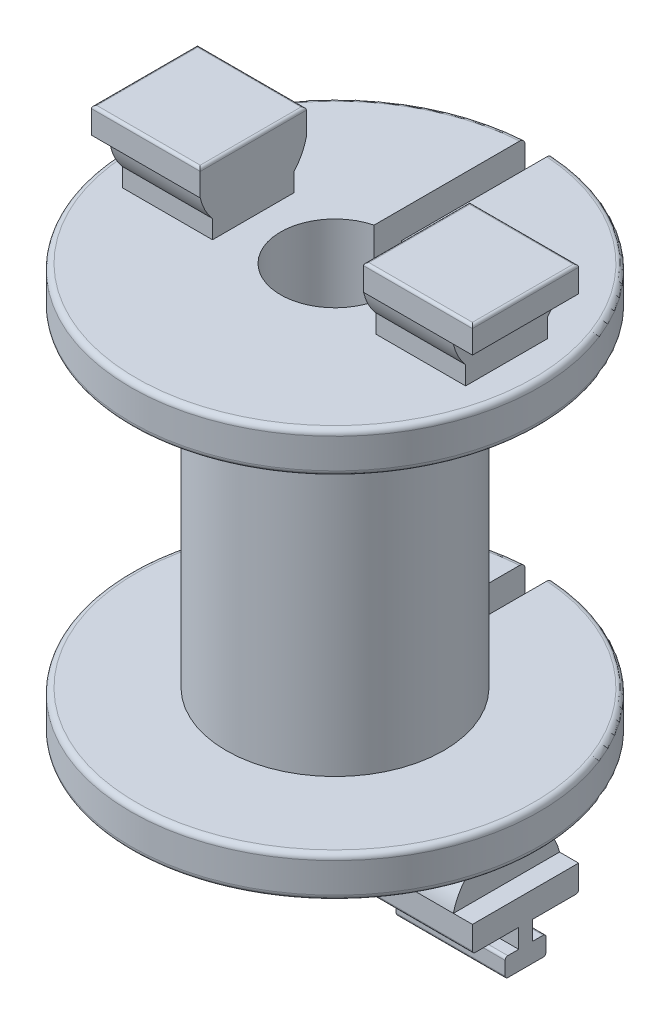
ISO-10303-21;
HEADER;
FILE_DESCRIPTION(('STEP AP214'),'2;1');
FILE_NAME('part.step','',(''),(''),'','','');
FILE_SCHEMA(('AUTOMOTIVE_DESIGN { 1 0 10303 214 1 1 1 1 }'));
ENDSEC;
DATA;
#1=APPLICATION_CONTEXT('core data for automotive mechanical design processes');
#2=APPLICATION_PROTOCOL_DEFINITION('international standard','automotive_design',2000,#1);
#3=PRODUCT_CONTEXT('',#1,'mechanical');
#4=PRODUCT('Part','Part','',(#3));
#5=PRODUCT_RELATED_PRODUCT_CATEGORY('part','',(#4));
#6=PRODUCT_DEFINITION_FORMATION('','',#4);
#7=PRODUCT_DEFINITION_CONTEXT('part definition',#1,'design');
#8=PRODUCT_DEFINITION('design','',#6,#7);
#9=PRODUCT_DEFINITION_SHAPE('','',#8);
#10=(LENGTH_UNIT() NAMED_UNIT(*) SI_UNIT(.MILLI.,.METRE.));
#11=(NAMED_UNIT(*) PLANE_ANGLE_UNIT() SI_UNIT($,.RADIAN.));
#12=(NAMED_UNIT(*) SI_UNIT($,.STERADIAN.) SOLID_ANGLE_UNIT());
#13=UNCERTAINTY_MEASURE_WITH_UNIT(LENGTH_MEASURE(1.E-05),#10,'distance_accuracy_value','');
#14=(GEOMETRIC_REPRESENTATION_CONTEXT(3) GLOBAL_UNCERTAINTY_ASSIGNED_CONTEXT((#13)) GLOBAL_UNIT_ASSIGNED_CONTEXT((#10,
#11,#12)) REPRESENTATION_CONTEXT('',''));
#15=CARTESIAN_POINT('',(0.,0.,0.));
#16=DIRECTION('',(0.,0.,1.));
#17=DIRECTION('',(1.,0.,0.));
#18=AXIS2_PLACEMENT_3D('',#15,#16,#17);
#19=CARTESIAN_POINT('',(-7.,-3.2,-0.25));
#20=DIRECTION('',(0.,0.,-1.));
#21=DIRECTION('',(0.,1.,0.));
#22=AXIS2_PLACEMENT_3D('',#19,#20,#21);
#23=PLANE('',#22);
#24=DIRECTION('',(0.,1.,0.));
#25=VECTOR('',#24,1.);
#26=CARTESIAN_POINT('',(-3.,-3.2,-0.25));
#27=LINE('',#26,#25);
#28=CARTESIAN_POINT('',(-3.,-3.2,-0.25));
#29=VERTEX_POINT('',#28);
#30=CARTESIAN_POINT('',(-3.,-2.5,-0.25));
#31=VERTEX_POINT('',#30);
#32=EDGE_CURVE('E952',#29,#31,#27,.T.);
#33=ORIENTED_EDGE('',*,*,#32,.F.);
#34=DIRECTION('',(1.,0.,0.));
#35=VECTOR('',#34,1.);
#36=CARTESIAN_POINT('',(-7.,-3.2,-0.25));
#37=LINE('',#36,#35);
#38=CARTESIAN_POINT('',(-7.,-3.2,-0.25));
#39=VERTEX_POINT('',#38);
#40=EDGE_CURVE('E990',#39,#29,#37,.T.);
#41=ORIENTED_EDGE('',*,*,#40,.F.);
#42=DIRECTION('',(0.,1.,0.));
#43=VECTOR('',#42,1.);
#44=CARTESIAN_POINT('',(-7.,-3.2,-0.25));
#45=LINE('',#44,#43);
#46=CARTESIAN_POINT('',(-7.,-2.5,-0.25));
#47=VERTEX_POINT('',#46);
#48=EDGE_CURVE('E938',#39,#47,#45,.T.);
#49=ORIENTED_EDGE('',*,*,#48,.T.);
#50=DIRECTION('',(1.,0.,0.));
#51=VECTOR('',#50,1.);
#52=CARTESIAN_POINT('',(-7.,-2.5,-0.25));
#53=LINE('',#52,#51);
#54=EDGE_CURVE('E997',#47,#31,#53,.T.);
#55=ORIENTED_EDGE('',*,*,#54,.T.);
#56=EDGE_LOOP('',(#33,#41,#49,#55));
#57=FACE_BOUND('',#56,.T.);
#58=ADVANCED_FACE('F34',(#57),#23,.T.);
#59=CARTESIAN_POINT('',(-7.,-3.2,-0.75));
#60=DIRECTION('',(0.,1.,0.));
#61=DIRECTION('',(0.,0.,1.));
#62=AXIS2_PLACEMENT_3D('',#59,#60,#61);
#63=PLANE('',#62);
#64=DIRECTION('',(0.,0.,1.));
#65=VECTOR('',#64,1.);
#66=CARTESIAN_POINT('',(-3.,-3.2,-0.75));
#67=LINE('',#66,#65);
#68=CARTESIAN_POINT('',(-3.,-3.2,-0.65));
#69=VERTEX_POINT('',#68);
#70=EDGE_CURVE('E929',#69,#29,#67,.T.);
#71=ORIENTED_EDGE('',*,*,#70,.F.);
#72=DIRECTION('',(1.,0.,0.));
#73=VECTOR('',#72,1.);
#74=CARTESIAN_POINT('',(-7.,-3.2,-0.65));
#75=LINE('',#74,#73);
#76=CARTESIAN_POINT('',(-7.,-3.2,-0.65));
#77=VERTEX_POINT('',#76);
#78=EDGE_CURVE('E612',#69,#77,#75,.F.);
#79=ORIENTED_EDGE('',*,*,#78,.T.);
#80=DIRECTION('',(0.,0.,1.));
#81=VECTOR('',#80,1.);
#82=CARTESIAN_POINT('',(-7.,-3.2,-0.75));
#83=LINE('',#82,#81);
#84=EDGE_CURVE('E927',#77,#39,#83,.T.);
#85=ORIENTED_EDGE('',*,*,#84,.T.);
#86=ORIENTED_EDGE('',*,*,#40,.T.);
#87=EDGE_LOOP('',(#71,#79,#85,#86));
#88=FACE_BOUND('',#87,.T.);
#89=ADVANCED_FACE('F925',(#88),#63,.T.);
#90=CARTESIAN_POINT('',(-7.,-3.9,-0.75));
#91=DIRECTION('',(0.,0.,-1.));
#92=DIRECTION('',(0.,1.,0.));
#93=AXIS2_PLACEMENT_3D('',#90,#91,#92);
#94=PLANE('',#93);
#95=DIRECTION('',(0.,1.,0.));
#96=VECTOR('',#95,1.);
#97=CARTESIAN_POINT('',(-7.,-3.9,-0.75));
#98=LINE('',#97,#96);
#99=CARTESIAN_POINT('',(-7.,-3.8,-0.75));
#100=VERTEX_POINT('',#99);
#101=CARTESIAN_POINT('',(-7.,-3.3,-0.75));
#102=VERTEX_POINT('',#101);
#103=EDGE_CURVE('E939',#100,#102,#98,.T.);
#104=ORIENTED_EDGE('',*,*,#103,.T.);
#105=DIRECTION('',(1.,0.,0.));
#106=VECTOR('',#105,1.);
#107=CARTESIAN_POINT('',(-7.,-3.3,-0.75));
#108=LINE('',#107,#106);
#109=CARTESIAN_POINT('',(-3.,-3.3,-0.75));
#110=VERTEX_POINT('',#109);
#111=EDGE_CURVE('E906',#102,#110,#108,.T.);
#112=ORIENTED_EDGE('',*,*,#111,.T.);
#113=DIRECTION('',(0.,1.,0.));
#114=VECTOR('',#113,1.);
#115=CARTESIAN_POINT('',(-3.,-3.9,-0.75));
#116=LINE('',#115,#114);
#117=CARTESIAN_POINT('',(-3.,-3.8,-0.75));
#118=VERTEX_POINT('',#117);
#119=EDGE_CURVE('E946',#118,#110,#116,.T.);
#120=ORIENTED_EDGE('',*,*,#119,.F.);
#121=DIRECTION('',(1.,0.,0.));
#122=VECTOR('',#121,1.);
#123=CARTESIAN_POINT('',(-7.,-3.8,-0.75));
#124=LINE('',#123,#122);
#125=EDGE_CURVE('E904',#118,#100,#124,.F.);
#126=ORIENTED_EDGE('',*,*,#125,.T.);
#127=EDGE_LOOP('',(#104,#112,#120,#126));
#128=FACE_BOUND('',#127,.T.);
#129=ADVANCED_FACE('F945',(#128),#94,.T.);
#130=CARTESIAN_POINT('',(-7.,-3.9,-0.75));
#131=DIRECTION('',(0.,-1.,0.));
#132=DIRECTION('',(0.,0.,-1.));
#133=AXIS2_PLACEMENT_3D('',#130,#131,#132);
#134=PLANE('',#133);
#135=DIRECTION('',(0.,0.,-1.));
#136=VECTOR('',#135,1.);
#137=CARTESIAN_POINT('',(-7.,-3.9,-0.75));
#138=LINE('',#137,#136);
#139=CARTESIAN_POINT('',(-7.,-3.9,0.65));
#140=VERTEX_POINT('',#139);
#141=CARTESIAN_POINT('',(-7.,-3.9,-0.65));
#142=VERTEX_POINT('',#141);
#143=EDGE_CURVE('E984',#140,#142,#138,.T.);
#144=ORIENTED_EDGE('',*,*,#143,.T.);
#145=DIRECTION('',(1.,0.,0.));
#146=VECTOR('',#145,1.);
#147=CARTESIAN_POINT('',(-7.,-3.9,-0.65));
#148=LINE('',#147,#146);
#149=CARTESIAN_POINT('',(-3.,-3.9,-0.65));
#150=VERTEX_POINT('',#149);
#151=EDGE_CURVE('E628',#142,#150,#148,.T.);
#152=ORIENTED_EDGE('',*,*,#151,.T.);
#153=DIRECTION('',(0.,0.,1.));
#154=VECTOR('',#153,1.);
#155=CARTESIAN_POINT('',(-3.,-3.9,-7.5));
#156=LINE('',#155,#154);
#157=CARTESIAN_POINT('',(-3.,-3.9,0.65));
#158=VERTEX_POINT('',#157);
#159=EDGE_CURVE('E1419',#150,#158,#156,.T.);
#160=ORIENTED_EDGE('',*,*,#159,.T.);
#161=DIRECTION('',(1.,0.,0.));
#162=VECTOR('',#161,1.);
#163=CARTESIAN_POINT('',(-7.,-3.9,0.65));
#164=LINE('',#163,#162);
#165=EDGE_CURVE('E626',#158,#140,#164,.F.);
#166=ORIENTED_EDGE('',*,*,#165,.T.);
#167=EDGE_LOOP('',(#144,#152,#160,#166));
#168=FACE_BOUND('',#167,.T.);
#169=ADVANCED_FACE('F1667',(#168),#134,.T.);
#170=CARTESIAN_POINT('',(-7.,-3.9,0.75));
#171=DIRECTION('',(0.,0.,1.));
#172=DIRECTION('',(1.,0.,0.));
#173=AXIS2_PLACEMENT_3D('',#170,#171,#172);
#174=PLANE('',#173);
#175=DIRECTION('',(0.,-1.,0.));
#176=VECTOR('',#175,1.);
#177=CARTESIAN_POINT('',(-3.,-3.9,0.75));
#178=LINE('',#177,#176);
#179=CARTESIAN_POINT('',(-3.,-3.3,0.75));
#180=VERTEX_POINT('',#179);
#181=CARTESIAN_POINT('',(-3.,-3.8,0.75));
#182=VERTEX_POINT('',#181);
#183=EDGE_CURVE('E950',#180,#182,#178,.T.);
#184=ORIENTED_EDGE('',*,*,#183,.F.);
#185=DIRECTION('',(1.,0.,0.));
#186=VECTOR('',#185,1.);
#187=CARTESIAN_POINT('',(-7.,-3.3,0.75));
#188=LINE('',#187,#186);
#189=CARTESIAN_POINT('',(-7.,-3.3,0.75));
#190=VERTEX_POINT('',#189);
#191=EDGE_CURVE('E637',#180,#190,#188,.F.);
#192=ORIENTED_EDGE('',*,*,#191,.T.);
#193=DIRECTION('',(0.,-1.,0.));
#194=VECTOR('',#193,1.);
#195=CARTESIAN_POINT('',(-7.,-3.9,0.75));
#196=LINE('',#195,#194);
#197=CARTESIAN_POINT('',(-7.,-3.8,0.75));
#198=VERTEX_POINT('',#197);
#199=EDGE_CURVE('E980',#190,#198,#196,.T.);
#200=ORIENTED_EDGE('',*,*,#199,.T.);
#201=DIRECTION('',(1.,0.,0.));
#202=VECTOR('',#201,1.);
#203=CARTESIAN_POINT('',(-7.,-3.8,0.75));
#204=LINE('',#203,#202);
#205=EDGE_CURVE('E634',#198,#182,#204,.T.);
#206=ORIENTED_EDGE('',*,*,#205,.T.);
#207=EDGE_LOOP('',(#184,#192,#200,#206));
#208=FACE_BOUND('',#207,.T.);
#209=ADVANCED_FACE('F1677',(#208),#174,.T.);
#210=CARTESIAN_POINT('',(-7.,-3.2,0.75));
#211=DIRECTION('',(0.,1.,0.));
#212=DIRECTION('',(0.,0.,1.));
#213=AXIS2_PLACEMENT_3D('',#210,#211,#212);
#214=PLANE('',#213);
#215=DIRECTION('',(0.,0.,1.));
#216=VECTOR('',#215,1.);
#217=CARTESIAN_POINT('',(-7.,-3.2,0.75));
#218=LINE('',#217,#216);
#219=CARTESIAN_POINT('',(-7.,-3.2,0.25));
#220=VERTEX_POINT('',#219);
#221=CARTESIAN_POINT('',(-7.,-3.2,0.65));
#222=VERTEX_POINT('',#221);
#223=EDGE_CURVE('E977',#220,#222,#218,.T.);
#224=ORIENTED_EDGE('',*,*,#223,.T.);
#225=DIRECTION('',(1.,0.,0.));
#226=VECTOR('',#225,1.);
#227=CARTESIAN_POINT('',(-7.,-3.2,0.65));
#228=LINE('',#227,#226);
#229=CARTESIAN_POINT('',(-3.,-3.2,0.65));
#230=VERTEX_POINT('',#229);
#231=EDGE_CURVE('E631',#222,#230,#228,.T.);
#232=ORIENTED_EDGE('',*,*,#231,.T.);
#233=DIRECTION('',(0.,0.,1.));
#234=VECTOR('',#233,1.);
#235=CARTESIAN_POINT('',(-3.,-3.2,0.75));
#236=LINE('',#235,#234);
#237=CARTESIAN_POINT('',(-3.,-3.2,0.25));
#238=VERTEX_POINT('',#237);
#239=EDGE_CURVE('E955',#238,#230,#236,.T.);
#240=ORIENTED_EDGE('',*,*,#239,.F.);
#241=DIRECTION('',(1.,0.,0.));
#242=VECTOR('',#241,1.);
#243=CARTESIAN_POINT('',(-7.,-3.2,0.25));
#244=LINE('',#243,#242);
#245=EDGE_CURVE('E1012',#220,#238,#244,.T.);
#246=ORIENTED_EDGE('',*,*,#245,.F.);
#247=EDGE_LOOP('',(#224,#232,#240,#246));
#248=FACE_BOUND('',#247,.T.);
#249=ADVANCED_FACE('F1407',(#248),#214,.T.);
#250=CARTESIAN_POINT('',(-7.,-3.2,0.25));
#251=DIRECTION('',(0.,0.,1.));
#252=DIRECTION('',(1.,0.,0.));
#253=AXIS2_PLACEMENT_3D('',#250,#251,#252);
#254=PLANE('',#253);
#255=DIRECTION('',(0.,-1.,0.));
#256=VECTOR('',#255,1.);
#257=CARTESIAN_POINT('',(-3.,-3.2,0.25));
#258=LINE('',#257,#256);
#259=CARTESIAN_POINT('',(-3.,-2.5,0.25));
#260=VERTEX_POINT('',#259);
#261=EDGE_CURVE('E546',#260,#238,#258,.T.);
#262=ORIENTED_EDGE('',*,*,#261,.F.);
#263=DIRECTION('',(1.,0.,0.));
#264=VECTOR('',#263,1.);
#265=CARTESIAN_POINT('',(-7.,-2.5,0.25));
#266=LINE('',#265,#264);
#267=CARTESIAN_POINT('',(-7.,-2.5,0.25));
#268=VERTEX_POINT('',#267);
#269=EDGE_CURVE('E1005',#268,#260,#266,.T.);
#270=ORIENTED_EDGE('',*,*,#269,.F.);
#271=DIRECTION('',(0.,-1.,0.));
#272=VECTOR('',#271,1.);
#273=CARTESIAN_POINT('',(-7.,-3.2,0.25));
#274=LINE('',#273,#272);
#275=EDGE_CURVE('E981',#268,#220,#274,.T.);
#276=ORIENTED_EDGE('',*,*,#275,.T.);
#277=ORIENTED_EDGE('',*,*,#245,.T.);
#278=EDGE_LOOP('',(#262,#270,#276,#277));
#279=FACE_BOUND('',#278,.T.);
#280=ADVANCED_FACE('F1403',(#279),#254,.T.);
#281=CARTESIAN_POINT('',(-6.3,-2.5,-1.95));
#282=DIRECTION('',(0.,1.,0.));
#283=DIRECTION('',(0.,0.,1.));
#284=AXIS2_PLACEMENT_3D('',#281,#282,#283);
#285=PLANE('',#284);
#286=DIRECTION('',(0.,0.,1.));
#287=VECTOR('',#286,1.);
#288=CARTESIAN_POINT('',(3.,-2.5,-7.5));
#289=LINE('',#288,#287);
#290=CARTESIAN_POINT('',(3.,-2.5,-1.85));
#291=VERTEX_POINT('',#290);
#292=CARTESIAN_POINT('',(3.,-2.5,-0.25));
#293=VERTEX_POINT('',#292);
#294=EDGE_CURVE('E1240',#291,#293,#289,.T.);
#295=ORIENTED_EDGE('',*,*,#294,.F.);
#296=DIRECTION('',(1.,0.,0.));
#297=VECTOR('',#296,1.);
#298=CARTESIAN_POINT('',(-6.3,-2.5,-1.85));
#299=LINE('',#298,#297);
#300=CARTESIAN_POINT('',(7.,-2.5,-1.85));
#301=VERTEX_POINT('',#300);
#302=EDGE_CURVE('E1305',#291,#301,#299,.T.);
#303=ORIENTED_EDGE('',*,*,#302,.T.);
#304=DIRECTION('',(0.,0.,1.));
#305=VECTOR('',#304,1.);
#306=CARTESIAN_POINT('',(7.,-2.5,1.95));
#307=LINE('',#306,#305);
#308=CARTESIAN_POINT('',(7.,-2.5,-0.25));
#309=VERTEX_POINT('',#308);
#310=EDGE_CURVE('E643',#301,#309,#307,.T.);
#311=ORIENTED_EDGE('',*,*,#310,.T.);
#312=EDGE_CURVE('E994',#293,#309,#53,.T.);
#313=ORIENTED_EDGE('',*,*,#312,.F.);
#314=EDGE_LOOP('',(#295,#303,#311,#313));
#315=FACE_BOUND('',#314,.T.);
#316=ADVANCED_FACE('F1238',(#315),#285,.F.);
#317=DIRECTION('',(0.,0.,1.));
#318=VECTOR('',#317,1.);
#319=CARTESIAN_POINT('',(-7.,-2.5,1.95));
#320=LINE('',#319,#318);
#321=CARTESIAN_POINT('',(-7.,-2.5,-1.85));
#322=VERTEX_POINT('',#321);
#323=EDGE_CURVE('E596',#322,#47,#320,.T.);
#324=ORIENTED_EDGE('',*,*,#323,.F.);
#325=DIRECTION('',(1.,0.,0.));
#326=VECTOR('',#325,1.);
#327=CARTESIAN_POINT('',(-6.3,-2.5,-1.85));
#328=LINE('',#327,#326);
#329=CARTESIAN_POINT('',(-3.,-2.5,-1.85));
#330=VERTEX_POINT('',#329);
#331=EDGE_CURVE('E43',#322,#330,#328,.T.);
#332=ORIENTED_EDGE('',*,*,#331,.T.);
#333=DIRECTION('',(0.,0.,1.));
#334=VECTOR('',#333,1.);
#335=CARTESIAN_POINT('',(-3.,-2.5,-7.5));
#336=LINE('',#335,#334);
#337=EDGE_CURVE('E1320',#330,#31,#336,.T.);
#338=ORIENTED_EDGE('',*,*,#337,.T.);
#339=ORIENTED_EDGE('',*,*,#54,.F.);
#340=EDGE_LOOP('',(#324,#332,#338,#339));
#341=FACE_BOUND('',#340,.T.);
#342=ADVANCED_FACE('F1318',(#341),#285,.F.);
#343=CARTESIAN_POINT('',(-6.3,-2.,0.));
#344=DIRECTION('',(1.,0.,0.));
#345=DIRECTION('',(0.,0.,-1.));
#346=AXIS2_PLACEMENT_3D('',#343,#344,#345);
#347=CYLINDRICAL_SURFACE('',#346,2.);
#348=CARTESIAN_POINT('',(3.,-2.,0.));
#349=DIRECTION('',(-1.,0.,0.));
#350=DIRECTION('',(0.,0.,1.));
#351=AXIS2_PLACEMENT_3D('',#348,#349,#350);
#352=CIRCLE('',#351,2.);
#353=CARTESIAN_POINT('',(3.,-1.55559027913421,1.95));
#354=VERTEX_POINT('',#353);
#355=CARTESIAN_POINT('',(3.,-0.677124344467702,1.5));
#356=VERTEX_POINT('',#355);
#357=EDGE_CURVE('E1340',#354,#356,#352,.T.);
#358=ORIENTED_EDGE('',*,*,#357,.F.);
#359=DIRECTION('',(1.,0.,0.));
#360=VECTOR('',#359,1.);
#361=CARTESIAN_POINT('',(-6.3,-1.55559027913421,1.95));
#362=LINE('',#361,#360);
#363=CARTESIAN_POINT('',(6.3,-1.55559027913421,1.95));
#364=VERTEX_POINT('',#363);
#365=EDGE_CURVE('E696',#354,#364,#362,.T.);
#366=ORIENTED_EDGE('',*,*,#365,.T.);
#367=CARTESIAN_POINT('',(6.3,-2.,0.));
#368=DIRECTION('',(-1.,0.,0.));
#369=DIRECTION('',(0.,0.,-1.));
#370=AXIS2_PLACEMENT_3D('',#367,#368,#369);
#371=CIRCLE('',#370,2.);
#372=CARTESIAN_POINT('',(6.3,-0.677124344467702,1.5));
#373=VERTEX_POINT('',#372);
#374=EDGE_CURVE('E668',#364,#373,#371,.T.);
#375=ORIENTED_EDGE('',*,*,#374,.T.);
#376=DIRECTION('',(1.,0.,0.));
#377=VECTOR('',#376,1.);
#378=CARTESIAN_POINT('',(-6.3,-0.677124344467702,1.5));
#379=LINE('',#378,#377);
#380=EDGE_CURVE('E701',#356,#373,#379,.T.);
#381=ORIENTED_EDGE('',*,*,#380,.F.);
#382=EDGE_LOOP('',(#358,#366,#375,#381));
#383=FACE_BOUND('',#382,.T.);
#384=ADVANCED_FACE('F1910',(#383),#347,.T.);
#385=CARTESIAN_POINT('',(-3.,-2.,0.));
#386=DIRECTION('',(1.,0.,0.));
#387=DIRECTION('',(0.,0.,-1.));
#388=AXIS2_PLACEMENT_3D('',#385,#386,#387);
#389=CIRCLE('',#388,2.);
#390=CARTESIAN_POINT('',(-3.,-0.677124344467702,1.5));
#391=VERTEX_POINT('',#390);
#392=CARTESIAN_POINT('',(-3.,-1.55559027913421,1.95));
#393=VERTEX_POINT('',#392);
#394=EDGE_CURVE('E1330',#391,#393,#389,.T.);
#395=ORIENTED_EDGE('',*,*,#394,.F.);
#396=CARTESIAN_POINT('',(-6.3,-0.677124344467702,1.5));
#397=VERTEX_POINT('',#396);
#398=EDGE_CURVE('E697',#397,#391,#379,.T.);
#399=ORIENTED_EDGE('',*,*,#398,.F.);
#400=CARTESIAN_POINT('',(-6.3,-2.,0.));
#401=DIRECTION('',(-1.,0.,0.));
#402=DIRECTION('',(0.,0.,-1.));
#403=AXIS2_PLACEMENT_3D('',#400,#401,#402);
#404=CIRCLE('',#403,2.);
#405=CARTESIAN_POINT('',(-6.3,-1.55559027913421,1.95));
#406=VERTEX_POINT('',#405);
#407=EDGE_CURVE('E683',#406,#397,#404,.T.);
#408=ORIENTED_EDGE('',*,*,#407,.F.);
#409=EDGE_CURVE('E716',#406,#393,#362,.T.);
#410=ORIENTED_EDGE('',*,*,#409,.T.);
#411=EDGE_LOOP('',(#395,#399,#408,#410));
#412=FACE_BOUND('',#411,.T.);
#413=ADVANCED_FACE('F1384',(#412),#347,.T.);
#414=CARTESIAN_POINT('',(-6.3,0.,1.5));
#415=DIRECTION('',(0.,0.,-1.));
#416=DIRECTION('',(-1.,0.,0.));
#417=AXIS2_PLACEMENT_3D('',#414,#415,#416);
#418=PLANE('',#417);
#419=DIRECTION('',(0.,1.,0.));
#420=VECTOR('',#419,1.);
#421=CARTESIAN_POINT('',(3.,0.,1.5));
#422=LINE('',#421,#420);
#423=CARTESIAN_POINT('',(3.,0.,1.5));
#424=VERTEX_POINT('',#423);
#425=EDGE_CURVE('E1342',#356,#424,#422,.T.);
#426=ORIENTED_EDGE('',*,*,#425,.F.);
#427=ORIENTED_EDGE('',*,*,#380,.T.);
#428=DIRECTION('',(0.,1.,0.));
#429=VECTOR('',#428,1.);
#430=CARTESIAN_POINT('',(6.3,0.,1.5));
#431=LINE('',#430,#429);
#432=CARTESIAN_POINT('',(6.3,0.,1.5));
#433=VERTEX_POINT('',#432);
#434=EDGE_CURVE('E680',#373,#433,#431,.T.);
#435=ORIENTED_EDGE('',*,*,#434,.T.);
#436=DIRECTION('',(1.,0.,0.));
#437=VECTOR('',#436,1.);
#438=CARTESIAN_POINT('',(-6.3,0.,1.5));
#439=LINE('',#438,#437);
#440=EDGE_CURVE('E589',#424,#433,#439,.T.);
#441=ORIENTED_EDGE('',*,*,#440,.F.);
#442=EDGE_LOOP('',(#426,#427,#435,#441));
#443=FACE_BOUND('',#442,.T.);
#444=ADVANCED_FACE('F1914',(#443),#418,.F.);
#445=DIRECTION('',(0.,-1.,0.));
#446=VECTOR('',#445,1.);
#447=CARTESIAN_POINT('',(-3.,0.,1.5));
#448=LINE('',#447,#446);
#449=CARTESIAN_POINT('',(-3.,0.,1.5));
#450=VERTEX_POINT('',#449);
#451=EDGE_CURVE('E1332',#450,#391,#448,.T.);
#452=ORIENTED_EDGE('',*,*,#451,.F.);
#453=CARTESIAN_POINT('',(-6.3,0.,1.5));
#454=VERTEX_POINT('',#453);
#455=EDGE_CURVE('E702',#454,#450,#439,.T.);
#456=ORIENTED_EDGE('',*,*,#455,.F.);
#457=DIRECTION('',(0.,1.,0.));
#458=VECTOR('',#457,1.);
#459=CARTESIAN_POINT('',(-6.3,0.,1.5));
#460=LINE('',#459,#458);
#461=EDGE_CURVE('E693',#397,#454,#460,.T.);
#462=ORIENTED_EDGE('',*,*,#461,.F.);
#463=ORIENTED_EDGE('',*,*,#398,.T.);
#464=EDGE_LOOP('',(#452,#456,#462,#463));
#465=FACE_BOUND('',#464,.T.);
#466=ADVANCED_FACE('F1379',(#465),#418,.F.);
#467=CARTESIAN_POINT('',(-6.3,0.,-1.5));
#468=DIRECTION('',(0.,0.,1.));
#469=DIRECTION('',(1.,0.,0.));
#470=AXIS2_PLACEMENT_3D('',#467,#468,#469);
#471=PLANE('',#470);
#472=DIRECTION('',(0.,-1.,0.));
#473=VECTOR('',#472,1.);
#474=CARTESIAN_POINT('',(3.,0.,-1.5));
#475=LINE('',#474,#473);
#476=CARTESIAN_POINT('',(3.,0.,-1.5));
#477=VERTEX_POINT('',#476);
#478=CARTESIAN_POINT('',(3.,-0.677124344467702,-1.5));
#479=VERTEX_POINT('',#478);
#480=EDGE_CURVE('E1349',#477,#479,#475,.T.);
#481=ORIENTED_EDGE('',*,*,#480,.F.);
#482=DIRECTION('',(1.,0.,0.));
#483=VECTOR('',#482,1.);
#484=CARTESIAN_POINT('',(-6.3,0.,-1.5));
#485=LINE('',#484,#483);
#486=CARTESIAN_POINT('',(6.3,0.,-1.5));
#487=VERTEX_POINT('',#486);
#488=EDGE_CURVE('E584',#477,#487,#485,.T.);
#489=ORIENTED_EDGE('',*,*,#488,.T.);
#490=DIRECTION('',(0.,-1.,0.));
#491=VECTOR('',#490,1.);
#492=CARTESIAN_POINT('',(6.3,0.,-1.5));
#493=LINE('',#492,#491);
#494=CARTESIAN_POINT('',(6.3,-0.677124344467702,-1.5));
#495=VERTEX_POINT('',#494);
#496=EDGE_CURVE('E674',#487,#495,#493,.T.);
#497=ORIENTED_EDGE('',*,*,#496,.T.);
#498=DIRECTION('',(1.,0.,0.));
#499=VECTOR('',#498,1.);
#500=CARTESIAN_POINT('',(-6.3,-0.677124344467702,-1.5));
#501=LINE('',#500,#499);
#502=EDGE_CURVE('E711',#479,#495,#501,.T.);
#503=ORIENTED_EDGE('',*,*,#502,.F.);
#504=EDGE_LOOP('',(#481,#489,#497,#503));
#505=FACE_BOUND('',#504,.T.);
#506=ADVANCED_FACE('F1920',(#505),#471,.F.);
#507=DIRECTION('',(0.,1.,0.));
#508=VECTOR('',#507,1.);
#509=CARTESIAN_POINT('',(-3.,0.,-1.5));
#510=LINE('',#509,#508);
#511=CARTESIAN_POINT('',(-3.,-0.677124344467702,-1.5));
#512=VERTEX_POINT('',#511);
#513=CARTESIAN_POINT('',(-3.,0.,-1.5));
#514=VERTEX_POINT('',#513);
#515=EDGE_CURVE('E1338',#512,#514,#510,.T.);
#516=ORIENTED_EDGE('',*,*,#515,.F.);
#517=CARTESIAN_POINT('',(-6.3,-0.677124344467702,-1.5));
#518=VERTEX_POINT('',#517);
#519=EDGE_CURVE('E708',#518,#512,#501,.T.);
#520=ORIENTED_EDGE('',*,*,#519,.F.);
#521=DIRECTION('',(0.,-1.,0.));
#522=VECTOR('',#521,1.);
#523=CARTESIAN_POINT('',(-6.3,0.,-1.5));
#524=LINE('',#523,#522);
#525=CARTESIAN_POINT('',(-6.3,0.,-1.5));
#526=VERTEX_POINT('',#525);
#527=EDGE_CURVE('E688',#526,#518,#524,.T.);
#528=ORIENTED_EDGE('',*,*,#527,.F.);
#529=EDGE_CURVE('E705',#526,#514,#485,.T.);
#530=ORIENTED_EDGE('',*,*,#529,.T.);
#531=EDGE_LOOP('',(#516,#520,#528,#530));
#532=FACE_BOUND('',#531,.T.);
#533=ADVANCED_FACE('F1371',(#532),#471,.F.);
#534=CARTESIAN_POINT('',(-6.3,-2.,0.));
#535=DIRECTION('',(1.,0.,0.));
#536=DIRECTION('',(0.,0.,-1.));
#537=AXIS2_PLACEMENT_3D('',#534,#535,#536);
#538=CYLINDRICAL_SURFACE('',#537,2.);
#539=CARTESIAN_POINT('',(3.,-2.,0.));
#540=DIRECTION('',(-1.,0.,0.));
#541=DIRECTION('',(0.,0.,1.));
#542=AXIS2_PLACEMENT_3D('',#539,#540,#541);
#543=CIRCLE('',#542,2.);
#544=CARTESIAN_POINT('',(3.,-1.55559027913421,-1.95));
#545=VERTEX_POINT('',#544);
#546=EDGE_CURVE('E1347',#479,#545,#543,.T.);
#547=ORIENTED_EDGE('',*,*,#546,.F.);
#548=ORIENTED_EDGE('',*,*,#502,.T.);
#549=CARTESIAN_POINT('',(6.3,-2.,0.));
#550=DIRECTION('',(-1.,0.,0.));
#551=DIRECTION('',(0.,0.,1.));
#552=AXIS2_PLACEMENT_3D('',#549,#550,#551);
#553=CIRCLE('',#552,2.);
#554=CARTESIAN_POINT('',(6.3,-1.55559027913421,-1.95));
#555=VERTEX_POINT('',#554);
#556=EDGE_CURVE('E671',#495,#555,#553,.T.);
#557=ORIENTED_EDGE('',*,*,#556,.T.);
#558=DIRECTION('',(1.,0.,0.));
#559=VECTOR('',#558,1.);
#560=CARTESIAN_POINT('',(-6.3,-1.55559027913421,-1.95));
#561=LINE('',#560,#559);
#562=EDGE_CURVE('E715',#545,#555,#561,.T.);
#563=ORIENTED_EDGE('',*,*,#562,.F.);
#564=EDGE_LOOP('',(#547,#548,#557,#563));
#565=FACE_BOUND('',#564,.T.);
#566=ADVANCED_FACE('F1875',(#565),#538,.T.);
#567=CARTESIAN_POINT('',(-3.,-2.,0.));
#568=DIRECTION('',(1.,0.,0.));
#569=DIRECTION('',(0.,0.,-1.));
#570=AXIS2_PLACEMENT_3D('',#567,#568,#569);
#571=CIRCLE('',#570,2.);
#572=CARTESIAN_POINT('',(-3.,-1.55559027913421,-1.95));
#573=VERTEX_POINT('',#572);
#574=EDGE_CURVE('E1336',#573,#512,#571,.T.);
#575=ORIENTED_EDGE('',*,*,#574,.F.);
#576=CARTESIAN_POINT('',(-6.3,-1.55559027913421,-1.95));
#577=VERTEX_POINT('',#576);
#578=EDGE_CURVE('E712',#577,#573,#561,.T.);
#579=ORIENTED_EDGE('',*,*,#578,.F.);
#580=CARTESIAN_POINT('',(-6.3,-2.,0.));
#581=DIRECTION('',(-1.,0.,0.));
#582=DIRECTION('',(0.,0.,1.));
#583=AXIS2_PLACEMENT_3D('',#580,#581,#582);
#584=CIRCLE('',#583,2.);
#585=EDGE_CURVE('E686',#518,#577,#584,.T.);
#586=ORIENTED_EDGE('',*,*,#585,.F.);
#587=ORIENTED_EDGE('',*,*,#519,.T.);
#588=EDGE_LOOP('',(#575,#579,#586,#587));
#589=FACE_BOUND('',#588,.T.);
#590=ADVANCED_FACE('F1365',(#589),#538,.T.);
#591=CARTESIAN_POINT('',(-6.3,-2.5,-1.95));
#592=DIRECTION('',(0.,0.,1.));
#593=DIRECTION('',(1.,0.,0.));
#594=AXIS2_PLACEMENT_3D('',#591,#592,#593);
#595=PLANE('',#594);
#596=DIRECTION('',(0.,-1.,0.));
#597=VECTOR('',#596,1.);
#598=CARTESIAN_POINT('',(7.,-2.5,-1.95));
#599=LINE('',#598,#597);
#600=CARTESIAN_POINT('',(7.,-1.55559027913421,-1.95));
#601=VERTEX_POINT('',#600);
#602=CARTESIAN_POINT('',(7.,-2.4,-1.95));
#603=VERTEX_POINT('',#602);
#604=EDGE_CURVE('E645',#601,#603,#599,.T.);
#605=ORIENTED_EDGE('',*,*,#604,.T.);
#606=DIRECTION('',(1.,0.,0.));
#607=VECTOR('',#606,1.);
#608=CARTESIAN_POINT('',(-6.3,-2.4,-1.95));
#609=LINE('',#608,#607);
#610=CARTESIAN_POINT('',(3.,-2.4,-1.95));
#611=VERTEX_POINT('',#610);
#612=EDGE_CURVE('E1307',#603,#611,#609,.F.);
#613=ORIENTED_EDGE('',*,*,#612,.T.);
#614=DIRECTION('',(0.,-1.,0.));
#615=VECTOR('',#614,1.);
#616=CARTESIAN_POINT('',(3.,-2.5,-1.95));
#617=LINE('',#616,#615);
#618=EDGE_CURVE('E1344',#545,#611,#617,.T.);
#619=ORIENTED_EDGE('',*,*,#618,.F.);
#620=ORIENTED_EDGE('',*,*,#562,.T.);
#621=DIRECTION('',(-1.,0.,0.));
#622=VECTOR('',#621,1.);
#623=CARTESIAN_POINT('',(7.,-1.55559027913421,-1.95));
#624=LINE('',#623,#622);
#625=EDGE_CURVE('E665',#601,#555,#624,.T.);
#626=ORIENTED_EDGE('',*,*,#625,.F.);
#627=EDGE_LOOP('',(#605,#613,#619,#620,#626));
#628=FACE_BOUND('',#627,.T.);
#629=ADVANCED_FACE('F1873',(#628),#595,.F.);
#630=DIRECTION('',(0.,1.,0.));
#631=VECTOR('',#630,1.);
#632=CARTESIAN_POINT('',(-3.,-2.5,-1.95));
#633=LINE('',#632,#631);
#634=CARTESIAN_POINT('',(-3.,-2.4,-1.95));
#635=VERTEX_POINT('',#634);
#636=EDGE_CURVE('E1334',#635,#573,#633,.T.);
#637=ORIENTED_EDGE('',*,*,#636,.F.);
#638=DIRECTION('',(1.,0.,0.));
#639=VECTOR('',#638,1.);
#640=CARTESIAN_POINT('',(-6.3,-2.4,-1.95));
#641=LINE('',#640,#639);
#642=CARTESIAN_POINT('',(-7.,-2.4,-1.95));
#643=VERTEX_POINT('',#642);
#644=EDGE_CURVE('E11',#635,#643,#641,.F.);
#645=ORIENTED_EDGE('',*,*,#644,.T.);
#646=DIRECTION('',(0.,-1.,0.));
#647=VECTOR('',#646,1.);
#648=CARTESIAN_POINT('',(-7.,-2.5,-1.95));
#649=LINE('',#648,#647);
#650=CARTESIAN_POINT('',(-7.,-1.55559027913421,-1.95));
#651=VERTEX_POINT('',#650);
#652=EDGE_CURVE('E597',#651,#643,#649,.T.);
#653=ORIENTED_EDGE('',*,*,#652,.F.);
#654=DIRECTION('',(1.,0.,0.));
#655=VECTOR('',#654,1.);
#656=CARTESIAN_POINT('',(-7.,-1.55559027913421,-1.95));
#657=LINE('',#656,#655);
#658=EDGE_CURVE('E611',#651,#577,#657,.T.);
#659=ORIENTED_EDGE('',*,*,#658,.T.);
#660=ORIENTED_EDGE('',*,*,#578,.T.);
#661=EDGE_LOOP('',(#637,#645,#653,#659,#660));
#662=FACE_BOUND('',#661,.T.);
#663=ADVANCED_FACE('F1360',(#662),#595,.F.);
#664=CARTESIAN_POINT('',(7.,-2.5,0.25));
#665=VERTEX_POINT('',#664);
#666=CARTESIAN_POINT('',(7.,-2.5,1.85));
#667=VERTEX_POINT('',#666);
#668=EDGE_CURVE('E598',#665,#667,#307,.T.);
#669=ORIENTED_EDGE('',*,*,#668,.T.);
#670=DIRECTION('',(1.,0.,0.));
#671=VECTOR('',#670,1.);
#672=CARTESIAN_POINT('',(-6.3,-2.5,1.85));
#673=LINE('',#672,#671);
#674=CARTESIAN_POINT('',(3.,-2.5,1.85));
#675=VERTEX_POINT('',#674);
#676=EDGE_CURVE('E59',#667,#675,#673,.F.);
#677=ORIENTED_EDGE('',*,*,#676,.T.);
#678=CARTESIAN_POINT('',(3.,-2.5,0.25));
#679=VERTEX_POINT('',#678);
#680=EDGE_CURVE('E1324',#679,#675,#289,.T.);
#681=ORIENTED_EDGE('',*,*,#680,.F.);
#682=EDGE_CURVE('E1002',#679,#665,#266,.T.);
#683=ORIENTED_EDGE('',*,*,#682,.T.);
#684=EDGE_LOOP('',(#669,#677,#681,#683));
#685=FACE_BOUND('',#684,.T.);
#686=ADVANCED_FACE('F1901',(#685),#285,.F.);
#687=CARTESIAN_POINT('',(-3.,-2.5,1.85));
#688=VERTEX_POINT('',#687);
#689=EDGE_CURVE('E1325',#260,#688,#336,.T.);
#690=ORIENTED_EDGE('',*,*,#689,.T.);
#691=DIRECTION('',(1.,0.,0.));
#692=VECTOR('',#691,1.);
#693=CARTESIAN_POINT('',(-6.3,-2.5,1.85));
#694=LINE('',#693,#692);
#695=CARTESIAN_POINT('',(-7.,-2.5,1.85));
#696=VERTEX_POINT('',#695);
#697=EDGE_CURVE('E1312',#688,#696,#694,.F.);
#698=ORIENTED_EDGE('',*,*,#697,.T.);
#699=EDGE_CURVE('E592',#268,#696,#320,.T.);
#700=ORIENTED_EDGE('',*,*,#699,.F.);
#701=ORIENTED_EDGE('',*,*,#269,.T.);
#702=EDGE_LOOP('',(#690,#698,#700,#701));
#703=FACE_BOUND('',#702,.T.);
#704=ADVANCED_FACE('F1397',(#703),#285,.F.);
#705=CARTESIAN_POINT('',(-6.3,-2.5,1.95));
#706=DIRECTION('',(0.,0.,-1.));
#707=DIRECTION('',(-1.,0.,0.));
#708=AXIS2_PLACEMENT_3D('',#705,#706,#707);
#709=PLANE('',#708);
#710=DIRECTION('',(0.,1.,0.));
#711=VECTOR('',#710,1.);
#712=CARTESIAN_POINT('',(3.,-2.5,1.95));
#713=LINE('',#712,#711);
#714=CARTESIAN_POINT('',(3.,-2.4,1.95));
#715=VERTEX_POINT('',#714);
#716=EDGE_CURVE('E588',#715,#354,#713,.T.);
#717=ORIENTED_EDGE('',*,*,#716,.F.);
#718=DIRECTION('',(1.,0.,0.));
#719=VECTOR('',#718,1.);
#720=CARTESIAN_POINT('',(-6.3,-2.4,1.95));
#721=LINE('',#720,#719);
#722=CARTESIAN_POINT('',(7.,-2.4,1.95));
#723=VERTEX_POINT('',#722);
#724=EDGE_CURVE('E1301',#715,#723,#721,.T.);
#725=ORIENTED_EDGE('',*,*,#724,.T.);
#726=DIRECTION('',(0.,1.,0.));
#727=VECTOR('',#726,1.);
#728=CARTESIAN_POINT('',(7.,-2.5,1.95));
#729=LINE('',#728,#727);
#730=CARTESIAN_POINT('',(7.,-1.55559027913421,1.95));
#731=VERTEX_POINT('',#730);
#732=EDGE_CURVE('E650',#723,#731,#729,.T.);
#733=ORIENTED_EDGE('',*,*,#732,.T.);
#734=DIRECTION('',(-1.,0.,0.));
#735=VECTOR('',#734,1.);
#736=CARTESIAN_POINT('',(7.,-1.55559027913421,1.95));
#737=LINE('',#736,#735);
#738=EDGE_CURVE('E658',#731,#364,#737,.T.);
#739=ORIENTED_EDGE('',*,*,#738,.T.);
#740=ORIENTED_EDGE('',*,*,#365,.F.);
#741=EDGE_LOOP('',(#717,#725,#733,#739,#740));
#742=FACE_BOUND('',#741,.T.);
#743=ADVANCED_FACE('F1904',(#742),#709,.F.);
#744=DIRECTION('',(0.,1.,0.));
#745=VECTOR('',#744,1.);
#746=CARTESIAN_POINT('',(-7.,-2.5,1.95));
#747=LINE('',#746,#745);
#748=CARTESIAN_POINT('',(-7.,-2.4,1.95));
#749=VERTEX_POINT('',#748);
#750=CARTESIAN_POINT('',(-7.,-1.55559027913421,1.95));
#751=VERTEX_POINT('',#750);
#752=EDGE_CURVE('E1351',#749,#751,#747,.T.);
#753=ORIENTED_EDGE('',*,*,#752,.F.);
#754=DIRECTION('',(1.,0.,0.));
#755=VECTOR('',#754,1.);
#756=CARTESIAN_POINT('',(-6.3,-2.4,1.95));
#757=LINE('',#756,#755);
#758=CARTESIAN_POINT('',(-3.,-2.4,1.95));
#759=VERTEX_POINT('',#758);
#760=EDGE_CURVE('E1309',#749,#759,#757,.T.);
#761=ORIENTED_EDGE('',*,*,#760,.T.);
#762=DIRECTION('',(0.,-1.,0.));
#763=VECTOR('',#762,1.);
#764=CARTESIAN_POINT('',(-3.,-2.5,1.95));
#765=LINE('',#764,#763);
#766=EDGE_CURVE('E585',#393,#759,#765,.T.);
#767=ORIENTED_EDGE('',*,*,#766,.F.);
#768=ORIENTED_EDGE('',*,*,#409,.F.);
#769=DIRECTION('',(1.,0.,0.));
#770=VECTOR('',#769,1.);
#771=CARTESIAN_POINT('',(-7.,-1.55559027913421,1.95));
#772=LINE('',#771,#770);
#773=EDGE_CURVE('E662',#751,#406,#772,.T.);
#774=ORIENTED_EDGE('',*,*,#773,.F.);
#775=EDGE_LOOP('',(#753,#761,#767,#768,#774));
#776=FACE_BOUND('',#775,.T.);
#777=ADVANCED_FACE('F1391',(#776),#709,.F.);
#778=CARTESIAN_POINT('',(-6.3,-2.,0.));
#779=DIRECTION('',(1.,0.,0.));
#780=DIRECTION('',(0.,0.,-1.));
#781=AXIS2_PLACEMENT_3D('',#778,#779,#780);
#782=PLANE('',#781);
#783=DIRECTION('',(0.,0.,-1.));
#784=VECTOR('',#783,1.);
#785=CARTESIAN_POINT('',(-6.3,-1.55559027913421,1.95));
#786=LINE('',#785,#784);
#787=EDGE_CURVE('E605',#406,#577,#786,.T.);
#788=ORIENTED_EDGE('',*,*,#787,.F.);
#789=ORIENTED_EDGE('',*,*,#407,.T.);
#790=ORIENTED_EDGE('',*,*,#461,.T.);
#791=DIRECTION('',(0.,0.,-1.));
#792=VECTOR('',#791,1.);
#793=CARTESIAN_POINT('',(-6.3,0.,-1.5));
#794=LINE('',#793,#792);
#795=EDGE_CURVE('E690',#454,#526,#794,.T.);
#796=ORIENTED_EDGE('',*,*,#795,.T.);
#797=ORIENTED_EDGE('',*,*,#527,.T.);
#798=ORIENTED_EDGE('',*,*,#585,.T.);
#799=EDGE_LOOP('',(#788,#789,#790,#796,#797,#798));
#800=FACE_BOUND('',#799,.T.);
#801=ADVANCED_FACE('F2058',(#800),#782,.F.);
#802=CARTESIAN_POINT('',(-6.3,17.,0.));
#803=DIRECTION('',(1.,0.,0.));
#804=DIRECTION('',(0.,0.,-1.));
#805=AXIS2_PLACEMENT_3D('',#802,#803,#804);
#806=CYLINDRICAL_SURFACE('',#805,2.);
#807=CARTESIAN_POINT('',(-3.,17.,0.));
#808=DIRECTION('',(-1.,0.,0.));
#809=DIRECTION('',(0.,0.,1.));
#810=AXIS2_PLACEMENT_3D('',#807,#808,#809);
#811=CIRCLE('',#810,2.);
#812=CARTESIAN_POINT('',(-3.,16.5555902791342,1.95));
#813=VERTEX_POINT('',#812);
#814=CARTESIAN_POINT('',(-3.,15.6771243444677,1.5));
#815=VERTEX_POINT('',#814);
#816=EDGE_CURVE('E734',#813,#815,#811,.F.);
#817=ORIENTED_EDGE('',*,*,#816,.F.);
#818=DIRECTION('',(1.,0.,0.));
#819=VECTOR('',#818,1.);
#820=CARTESIAN_POINT('',(-6.3,16.5555902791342,1.95));
#821=LINE('',#820,#819);
#822=CARTESIAN_POINT('',(-6.3,16.5555902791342,1.95));
#823=VERTEX_POINT('',#822);
#824=EDGE_CURVE('E564',#823,#813,#821,.T.);
#825=ORIENTED_EDGE('',*,*,#824,.F.);
#826=CARTESIAN_POINT('',(-6.3,17.,0.));
#827=DIRECTION('',(1.,0.,0.));
#828=DIRECTION('',(0.,0.,-1.));
#829=AXIS2_PLACEMENT_3D('',#826,#827,#828);
#830=CIRCLE('',#829,2.);
#831=CARTESIAN_POINT('',(-6.3,15.6771243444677,1.5));
#832=VERTEX_POINT('',#831);
#833=EDGE_CURVE('E791',#823,#832,#830,.T.);
#834=ORIENTED_EDGE('',*,*,#833,.T.);
#835=DIRECTION('',(1.,0.,0.));
#836=VECTOR('',#835,1.);
#837=CARTESIAN_POINT('',(-6.3,15.6771243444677,1.5));
#838=LINE('',#837,#836);
#839=EDGE_CURVE('E820',#832,#815,#838,.T.);
#840=ORIENTED_EDGE('',*,*,#839,.T.);
#841=EDGE_LOOP('',(#817,#825,#834,#840));
#842=FACE_BOUND('',#841,.T.);
#843=ADVANCED_FACE('F1173',(#842),#806,.T.);
#844=CARTESIAN_POINT('',(-6.3,17.5,1.95));
#845=DIRECTION('',(0.,0.,1.));
#846=DIRECTION('',(1.,0.,0.));
#847=AXIS2_PLACEMENT_3D('',#844,#845,#846);
#848=PLANE('',#847);
#849=DIRECTION('',(0.,-1.,0.));
#850=VECTOR('',#849,1.);
#851=CARTESIAN_POINT('',(-3.,17.5,1.95));
#852=LINE('',#851,#850);
#853=CARTESIAN_POINT('',(-3.,17.4,1.95));
#854=VERTEX_POINT('',#853);
#855=EDGE_CURVE('E736',#854,#813,#852,.T.);
#856=ORIENTED_EDGE('',*,*,#855,.F.);
#857=DIRECTION('',(1.,0.,0.));
#858=VECTOR('',#857,1.);
#859=CARTESIAN_POINT('',(-6.3,17.4,1.95));
#860=LINE('',#859,#858);
#861=CARTESIAN_POINT('',(-7.,17.4,1.95));
#862=VERTEX_POINT('',#861);
#863=EDGE_CURVE('E895',#854,#862,#860,.F.);
#864=ORIENTED_EDGE('',*,*,#863,.T.);
#865=DIRECTION('',(0.,-1.,0.));
#866=VECTOR('',#865,1.);
#867=CARTESIAN_POINT('',(-7.,17.5,1.95));
#868=LINE('',#867,#866);
#869=CARTESIAN_POINT('',(-7.,16.5555902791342,1.95));
#870=VERTEX_POINT('',#869);
#871=EDGE_CURVE('E746',#862,#870,#868,.T.);
#872=ORIENTED_EDGE('',*,*,#871,.T.);
#873=DIRECTION('',(1.,0.,0.));
#874=VECTOR('',#873,1.);
#875=CARTESIAN_POINT('',(-7.,16.5555902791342,1.95));
#876=LINE('',#875,#874);
#877=EDGE_CURVE('E754',#870,#823,#876,.T.);
#878=ORIENTED_EDGE('',*,*,#877,.T.);
#879=ORIENTED_EDGE('',*,*,#824,.T.);
#880=EDGE_LOOP('',(#856,#864,#872,#878,#879));
#881=FACE_BOUND('',#880,.T.);
#882=ADVANCED_FACE('F1162',(#881),#848,.T.);
#883=CARTESIAN_POINT('',(-6.3,17.5,-1.95));
#884=DIRECTION('',(0.,1.,0.));
#885=DIRECTION('',(0.,0.,1.));
#886=AXIS2_PLACEMENT_3D('',#883,#884,#885);
#887=PLANE('',#886);
#888=DIRECTION('',(0.,0.,1.));
#889=VECTOR('',#888,1.);
#890=CARTESIAN_POINT('',(-6.9,17.5,-1.95));
#891=LINE('',#890,#889);
#892=CARTESIAN_POINT('',(-6.9,17.5,-1.85));
#893=VERTEX_POINT('',#892);
#894=CARTESIAN_POINT('',(-6.9,17.5,1.85));
#895=VERTEX_POINT('',#894);
#896=EDGE_CURVE('E890',#893,#895,#891,.T.);
#897=ORIENTED_EDGE('',*,*,#896,.T.);
#898=DIRECTION('',(1.,0.,0.));
#899=VECTOR('',#898,1.);
#900=CARTESIAN_POINT('',(-6.3,17.5,1.85));
#901=LINE('',#900,#899);
#902=CARTESIAN_POINT('',(-3.1,17.5,1.85));
#903=VERTEX_POINT('',#902);
#904=EDGE_CURVE('E892',#895,#903,#901,.T.);
#905=ORIENTED_EDGE('',*,*,#904,.T.);
#906=DIRECTION('',(0.,0.,1.));
#907=VECTOR('',#906,1.);
#908=CARTESIAN_POINT('',(-3.1,17.5,-1.95));
#909=LINE('',#908,#907);
#910=CARTESIAN_POINT('',(-3.1,17.5,-1.85));
#911=VERTEX_POINT('',#910);
#912=EDGE_CURVE('E882',#903,#911,#909,.F.);
#913=ORIENTED_EDGE('',*,*,#912,.T.);
#914=DIRECTION('',(1.,0.,0.));
#915=VECTOR('',#914,1.);
#916=CARTESIAN_POINT('',(-6.3,17.5,-1.85));
#917=LINE('',#916,#915);
#918=EDGE_CURVE('E884',#911,#893,#917,.F.);
#919=ORIENTED_EDGE('',*,*,#918,.T.);
#920=EDGE_LOOP('',(#897,#905,#913,#919));
#921=FACE_BOUND('',#920,.T.);
#922=ADVANCED_FACE('F1152',(#921),#887,.T.);
#923=CARTESIAN_POINT('',(-6.3,17.5,-1.95));
#924=DIRECTION('',(0.,0.,-1.));
#925=DIRECTION('',(-1.,0.,0.));
#926=AXIS2_PLACEMENT_3D('',#923,#924,#925);
#927=PLANE('',#926);
#928=DIRECTION('',(0.,1.,0.));
#929=VECTOR('',#928,1.);
#930=CARTESIAN_POINT('',(-7.,17.5,-1.95));
#931=LINE('',#930,#929);
#932=CARTESIAN_POINT('',(-7.,16.5555902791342,-1.95));
#933=VERTEX_POINT('',#932);
#934=CARTESIAN_POINT('',(-7.,17.4,-1.95));
#935=VERTEX_POINT('',#934);
#936=EDGE_CURVE('E748',#933,#935,#931,.T.);
#937=ORIENTED_EDGE('',*,*,#936,.T.);
#938=DIRECTION('',(1.,0.,0.));
#939=VECTOR('',#938,1.);
#940=CARTESIAN_POINT('',(-6.3,17.4,-1.95));
#941=LINE('',#940,#939);
#942=CARTESIAN_POINT('',(-3.,17.4,-1.95));
#943=VERTEX_POINT('',#942);
#944=EDGE_CURVE('E900',#935,#943,#941,.T.);
#945=ORIENTED_EDGE('',*,*,#944,.T.);
#946=DIRECTION('',(0.,1.,0.));
#947=VECTOR('',#946,1.);
#948=CARTESIAN_POINT('',(-3.,17.5,-1.95));
#949=LINE('',#948,#947);
#950=CARTESIAN_POINT('',(-3.,16.5555902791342,-1.95));
#951=VERTEX_POINT('',#950);
#952=EDGE_CURVE('E742',#951,#943,#949,.T.);
#953=ORIENTED_EDGE('',*,*,#952,.F.);
#954=DIRECTION('',(1.,0.,0.));
#955=VECTOR('',#954,1.);
#956=CARTESIAN_POINT('',(-6.3,16.5555902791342,-1.95));
#957=LINE('',#956,#955);
#958=CARTESIAN_POINT('',(-6.3,16.5555902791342,-1.95));
#959=VERTEX_POINT('',#958);
#960=EDGE_CURVE('E807',#959,#951,#957,.T.);
#961=ORIENTED_EDGE('',*,*,#960,.F.);
#962=DIRECTION('',(1.,0.,0.));
#963=VECTOR('',#962,1.);
#964=CARTESIAN_POINT('',(-7.,16.5555902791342,-1.95));
#965=LINE('',#964,#963);
#966=EDGE_CURVE('E758',#933,#959,#965,.T.);
#967=ORIENTED_EDGE('',*,*,#966,.F.);
#968=EDGE_LOOP('',(#937,#945,#953,#961,#967));
#969=FACE_BOUND('',#968,.T.);
#970=ADVANCED_FACE('F1195',(#969),#927,.T.);
#971=CARTESIAN_POINT('',(-6.3,17.,0.));
#972=DIRECTION('',(1.,0.,0.));
#973=DIRECTION('',(0.,0.,-1.));
#974=AXIS2_PLACEMENT_3D('',#971,#972,#973);
#975=CYLINDRICAL_SURFACE('',#974,2.);
#976=CARTESIAN_POINT('',(-3.,17.,0.));
#977=DIRECTION('',(-1.,0.,0.));
#978=DIRECTION('',(0.,0.,1.));
#979=AXIS2_PLACEMENT_3D('',#976,#977,#978);
#980=CIRCLE('',#979,2.);
#981=CARTESIAN_POINT('',(-3.,15.6771243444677,-1.5));
#982=VERTEX_POINT('',#981);
#983=EDGE_CURVE('E740',#982,#951,#980,.F.);
#984=ORIENTED_EDGE('',*,*,#983,.F.);
#985=DIRECTION('',(1.,0.,0.));
#986=VECTOR('',#985,1.);
#987=CARTESIAN_POINT('',(-6.3,15.6771243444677,-1.5));
#988=LINE('',#987,#986);
#989=CARTESIAN_POINT('',(-6.3,15.6771243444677,-1.5));
#990=VERTEX_POINT('',#989);
#991=EDGE_CURVE('E811',#990,#982,#988,.T.);
#992=ORIENTED_EDGE('',*,*,#991,.F.);
#993=CARTESIAN_POINT('',(-6.3,17.,0.));
#994=DIRECTION('',(1.,0.,0.));
#995=DIRECTION('',(0.,0.,1.));
#996=AXIS2_PLACEMENT_3D('',#993,#994,#995);
#997=CIRCLE('',#996,2.);
#998=EDGE_CURVE('E803',#990,#959,#997,.T.);
#999=ORIENTED_EDGE('',*,*,#998,.T.);
#1000=ORIENTED_EDGE('',*,*,#960,.T.);
#1001=EDGE_LOOP('',(#984,#992,#999,#1000));
#1002=FACE_BOUND('',#1001,.T.);
#1003=ADVANCED_FACE('F1192',(#1002),#975,.T.);
#1004=CARTESIAN_POINT('',(-6.3,15.,-1.5));
#1005=DIRECTION('',(0.,0.,-1.));
#1006=DIRECTION('',(-1.,0.,0.));
#1007=AXIS2_PLACEMENT_3D('',#1004,#1005,#1006);
#1008=PLANE('',#1007);
#1009=DIRECTION('',(0.,1.,0.));
#1010=VECTOR('',#1009,1.);
#1011=CARTESIAN_POINT('',(-3.,15.,-1.5));
#1012=LINE('',#1011,#1010);
#1013=CARTESIAN_POINT('',(-3.,15.,-1.5));
#1014=VERTEX_POINT('',#1013);
#1015=EDGE_CURVE('E738',#1014,#982,#1012,.T.);
#1016=ORIENTED_EDGE('',*,*,#1015,.F.);
#1017=DIRECTION('',(1.,0.,0.));
#1018=VECTOR('',#1017,1.);
#1019=CARTESIAN_POINT('',(-6.3,15.,-1.5));
#1020=LINE('',#1019,#1018);
#1021=CARTESIAN_POINT('',(-6.3,15.,-1.5));
#1022=VERTEX_POINT('',#1021);
#1023=EDGE_CURVE('E815',#1022,#1014,#1020,.T.);
#1024=ORIENTED_EDGE('',*,*,#1023,.F.);
#1025=DIRECTION('',(0.,1.,0.));
#1026=VECTOR('',#1025,1.);
#1027=CARTESIAN_POINT('',(-6.3,15.,-1.5));
#1028=LINE('',#1027,#1026);
#1029=EDGE_CURVE('E800',#1022,#990,#1028,.T.);
#1030=ORIENTED_EDGE('',*,*,#1029,.T.);
#1031=ORIENTED_EDGE('',*,*,#991,.T.);
#1032=EDGE_LOOP('',(#1016,#1024,#1030,#1031));
#1033=FACE_BOUND('',#1032,.T.);
#1034=ADVANCED_FACE('F1190',(#1033),#1008,.T.);
#1035=CARTESIAN_POINT('',(-6.3,15.,1.5));
#1036=DIRECTION('',(0.,0.,1.));
#1037=DIRECTION('',(1.,0.,0.));
#1038=AXIS2_PLACEMENT_3D('',#1035,#1036,#1037);
#1039=PLANE('',#1038);
#1040=DIRECTION('',(0.,-1.,0.));
#1041=VECTOR('',#1040,1.);
#1042=CARTESIAN_POINT('',(-3.,15.,1.5));
#1043=LINE('',#1042,#1041);
#1044=CARTESIAN_POINT('',(-3.,15.,1.5));
#1045=VERTEX_POINT('',#1044);
#1046=EDGE_CURVE('E581',#815,#1045,#1043,.T.);
#1047=ORIENTED_EDGE('',*,*,#1046,.F.);
#1048=ORIENTED_EDGE('',*,*,#839,.F.);
#1049=DIRECTION('',(0.,-1.,0.));
#1050=VECTOR('',#1049,1.);
#1051=CARTESIAN_POINT('',(-6.3,15.,1.5));
#1052=LINE('',#1051,#1050);
#1053=CARTESIAN_POINT('',(-6.3,15.,1.5));
#1054=VERTEX_POINT('',#1053);
#1055=EDGE_CURVE('E794',#832,#1054,#1052,.T.);
#1056=ORIENTED_EDGE('',*,*,#1055,.T.);
#1057=DIRECTION('',(1.,0.,0.));
#1058=VECTOR('',#1057,1.);
#1059=CARTESIAN_POINT('',(-6.3,15.,1.5));
#1060=LINE('',#1059,#1058);
#1061=EDGE_CURVE('E818',#1054,#1045,#1060,.T.);
#1062=ORIENTED_EDGE('',*,*,#1061,.T.);
#1063=EDGE_LOOP('',(#1047,#1048,#1056,#1062));
#1064=FACE_BOUND('',#1063,.T.);
#1065=ADVANCED_FACE('F1182',(#1064),#1039,.T.);
#1066=CARTESIAN_POINT('',(6.3,17.,0.));
#1067=DIRECTION('',(1.,0.,0.));
#1068=DIRECTION('',(0.,0.,-1.));
#1069=AXIS2_PLACEMENT_3D('',#1066,#1067,#1068);
#1070=PLANE('',#1069);
#1071=CARTESIAN_POINT('',(6.3,17.,0.));
#1072=DIRECTION('',(1.,0.,0.));
#1073=DIRECTION('',(0.,0.,1.));
#1074=AXIS2_PLACEMENT_3D('',#1071,#1072,#1073);
#1075=CIRCLE('',#1074,2.);
#1076=CARTESIAN_POINT('',(6.3,15.6771243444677,-1.5));
#1077=VERTEX_POINT('',#1076);
#1078=CARTESIAN_POINT('',(6.3,16.5555902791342,-1.95));
#1079=VERTEX_POINT('',#1078);
#1080=EDGE_CURVE('E788',#1077,#1079,#1075,.T.);
#1081=ORIENTED_EDGE('',*,*,#1080,.T.);
#1082=DIRECTION('',(0.,0.,-1.));
#1083=VECTOR('',#1082,1.);
#1084=CARTESIAN_POINT('',(6.3,16.5555902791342,1.95));
#1085=LINE('',#1084,#1083);
#1086=CARTESIAN_POINT('',(6.3,16.5555902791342,1.95));
#1087=VERTEX_POINT('',#1086);
#1088=EDGE_CURVE('E760',#1087,#1079,#1085,.T.);
#1089=ORIENTED_EDGE('',*,*,#1088,.F.);
#1090=CARTESIAN_POINT('',(6.3,17.,0.));
#1091=DIRECTION('',(1.,0.,0.));
#1092=DIRECTION('',(0.,0.,-1.));
#1093=AXIS2_PLACEMENT_3D('',#1090,#1091,#1092);
#1094=CIRCLE('',#1093,2.);
#1095=CARTESIAN_POINT('',(6.3,15.6771243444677,1.5));
#1096=VERTEX_POINT('',#1095);
#1097=EDGE_CURVE('E776',#1087,#1096,#1094,.T.);
#1098=ORIENTED_EDGE('',*,*,#1097,.T.);
#1099=DIRECTION('',(0.,-1.,0.));
#1100=VECTOR('',#1099,1.);
#1101=CARTESIAN_POINT('',(6.3,15.,1.5));
#1102=LINE('',#1101,#1100);
#1103=CARTESIAN_POINT('',(6.3,15.,1.5));
#1104=VERTEX_POINT('',#1103);
#1105=EDGE_CURVE('E779',#1096,#1104,#1102,.T.);
#1106=ORIENTED_EDGE('',*,*,#1105,.T.);
#1107=DIRECTION('',(0.,0.,-1.));
#1108=VECTOR('',#1107,1.);
#1109=CARTESIAN_POINT('',(6.3,15.,-1.5));
#1110=LINE('',#1109,#1108);
#1111=CARTESIAN_POINT('',(6.3,15.,-1.5));
#1112=VERTEX_POINT('',#1111);
#1113=EDGE_CURVE('E782',#1104,#1112,#1110,.T.);
#1114=ORIENTED_EDGE('',*,*,#1113,.T.);
#1115=DIRECTION('',(0.,1.,0.));
#1116=VECTOR('',#1115,1.);
#1117=CARTESIAN_POINT('',(6.3,15.,-1.5));
#1118=LINE('',#1117,#1116);
#1119=EDGE_CURVE('E785',#1112,#1077,#1118,.T.);
#1120=ORIENTED_EDGE('',*,*,#1119,.T.);
#1121=EDGE_LOOP('',(#1081,#1089,#1098,#1106,#1114,#1120));
#1122=FACE_BOUND('',#1121,.T.);
#1123=ADVANCED_FACE('F838',(#1122),#1070,.T.);
#1124=CARTESIAN_POINT('',(0.,15.,0.));
#1125=DIRECTION('',(0.,1.,0.));
#1126=DIRECTION('',(0.,0.,1.));
#1127=AXIS2_PLACEMENT_3D('',#1124,#1125,#1126);
#1128=PLANE('',#1127);
#1129=DIRECTION('',(0.,0.,1.));
#1130=VECTOR('',#1129,1.);
#1131=CARTESIAN_POINT('',(-0.5,15.,0.));
#1132=LINE('',#1131,#1130);
#1133=CARTESIAN_POINT('',(-0.5,15.,-7.28285658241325));
#1134=VERTEX_POINT('',#1133);
#1135=CARTESIAN_POINT('',(-0.5,15.,-1.93649167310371));
#1136=VERTEX_POINT('',#1135);
#1137=EDGE_CURVE('E557',#1134,#1136,#1132,.T.);
#1138=ORIENTED_EDGE('',*,*,#1137,.F.);
#1139=CARTESIAN_POINT('',(0.,15.,0.));
#1140=DIRECTION('',(0.,1.,0.));
#1141=DIRECTION('',(0.,0.,1.));
#1142=AXIS2_PLACEMENT_3D('',#1139,#1140,#1141);
#1143=CIRCLE('',#1142,7.3);
#1144=CARTESIAN_POINT('',(0.5,15.,-7.28285658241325));
#1145=VERTEX_POINT('',#1144);
#1146=EDGE_CURVE('E556',#1134,#1145,#1143,.T.);
#1147=ORIENTED_EDGE('',*,*,#1146,.T.);
#1148=DIRECTION('',(0.,0.,-1.));
#1149=VECTOR('',#1148,1.);
#1150=CARTESIAN_POINT('',(0.5,15.,0.));
#1151=LINE('',#1150,#1149);
#1152=CARTESIAN_POINT('',(0.5,15.,-1.93649167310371));
#1153=VERTEX_POINT('',#1152);
#1154=EDGE_CURVE('E538',#1153,#1145,#1151,.T.);
#1155=ORIENTED_EDGE('',*,*,#1154,.F.);
#1156=CARTESIAN_POINT('',(0.,15.,0.));
#1157=DIRECTION('',(0.,1.,0.));
#1158=DIRECTION('',(0.,0.,1.));
#1159=AXIS2_PLACEMENT_3D('',#1156,#1157,#1158);
#1160=CIRCLE('',#1159,2.);
#1161=EDGE_CURVE('E554',#1136,#1153,#1160,.T.);
#1162=ORIENTED_EDGE('',*,*,#1161,.F.);
#1163=EDGE_LOOP('',(#1138,#1147,#1155,#1162));
#1164=FACE_BOUND('',#1163,.T.);
#1165=ORIENTED_EDGE('',*,*,#1023,.T.);
#1166=DIRECTION('',(0.,0.,1.));
#1167=VECTOR('',#1166,1.);
#1168=CARTESIAN_POINT('',(-3.,15.,-7.5));
#1169=LINE('',#1168,#1167);
#1170=EDGE_CURVE('E719',#1014,#1045,#1169,.T.);
#1171=ORIENTED_EDGE('',*,*,#1170,.T.);
#1172=ORIENTED_EDGE('',*,*,#1061,.F.);
#1173=DIRECTION('',(0.,0.,-1.));
#1174=VECTOR('',#1173,1.);
#1175=CARTESIAN_POINT('',(-6.3,15.,-1.5));
#1176=LINE('',#1175,#1174);
#1177=EDGE_CURVE('E797',#1054,#1022,#1176,.T.);
#1178=ORIENTED_EDGE('',*,*,#1177,.T.);
#1179=EDGE_LOOP('',(#1165,#1171,#1172,#1178));
#1180=FACE_BOUND('',#1179,.T.);
#1181=CARTESIAN_POINT('',(3.,15.,1.5));
#1182=VERTEX_POINT('',#1181);
#1183=EDGE_CURVE('E576',#1182,#1104,#1060,.T.);
#1184=ORIENTED_EDGE('',*,*,#1183,.F.);
#1185=DIRECTION('',(0.,0.,1.));
#1186=VECTOR('',#1185,1.);
#1187=CARTESIAN_POINT('',(3.,15.,-7.5));
#1188=LINE('',#1187,#1186);
#1189=CARTESIAN_POINT('',(3.,15.,-1.5));
#1190=VERTEX_POINT('',#1189);
#1191=EDGE_CURVE('E700',#1190,#1182,#1188,.T.);
#1192=ORIENTED_EDGE('',*,*,#1191,.F.);
#1193=EDGE_CURVE('E582',#1190,#1112,#1020,.T.);
#1194=ORIENTED_EDGE('',*,*,#1193,.T.);
#1195=ORIENTED_EDGE('',*,*,#1113,.F.);
#1196=EDGE_LOOP('',(#1184,#1192,#1194,#1195));
#1197=FACE_BOUND('',#1196,.T.);
#1198=ADVANCED_FACE('F552',(#1164,#1180,#1197),#1128,.T.);
#1199=CARTESIAN_POINT('',(0.,1.5,0.));
#1200=DIRECTION('',(0.,1.,0.));
#1201=DIRECTION('',(0.,0.,1.));
#1202=AXIS2_PLACEMENT_3D('',#1199,#1200,#1201);
#1203=PLANE('',#1202);
#1204=DIRECTION('',(0.,0.,1.));
#1205=VECTOR('',#1204,1.);
#1206=CARTESIAN_POINT('',(-0.5,1.5,0.));
#1207=LINE('',#1206,#1205);
#1208=CARTESIAN_POINT('',(-0.5,1.5,-7.28285658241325));
#1209=VERTEX_POINT('',#1208);
#1210=CARTESIAN_POINT('',(-0.5,1.5,-3.96862696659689));
#1211=VERTEX_POINT('',#1210);
#1212=EDGE_CURVE('E1432',#1209,#1211,#1207,.T.);
#1213=ORIENTED_EDGE('',*,*,#1212,.F.);
#1214=CARTESIAN_POINT('',(0.,1.5,0.));
#1215=DIRECTION('',(0.,1.,0.));
#1216=DIRECTION('',(0.,0.,1.));
#1217=AXIS2_PLACEMENT_3D('',#1214,#1215,#1216);
#1218=CIRCLE('',#1217,7.3);
#1219=CARTESIAN_POINT('',(0.5,1.5,-7.28285658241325));
#1220=VERTEX_POINT('',#1219);
#1221=EDGE_CURVE('E1099',#1209,#1220,#1218,.T.);
#1222=ORIENTED_EDGE('',*,*,#1221,.T.);
#1223=DIRECTION('',(0.,0.,-1.));
#1224=VECTOR('',#1223,1.);
#1225=CARTESIAN_POINT('',(0.5,1.5,0.));
#1226=LINE('',#1225,#1224);
#1227=CARTESIAN_POINT('',(0.5,1.5,-3.96862696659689));
#1228=VERTEX_POINT('',#1227);
#1229=EDGE_CURVE('E1448',#1228,#1220,#1226,.T.);
#1230=ORIENTED_EDGE('',*,*,#1229,.F.);
#1231=CARTESIAN_POINT('',(0.,1.5,0.));
#1232=DIRECTION('',(0.,1.,0.));
#1233=DIRECTION('',(0.,0.,1.));
#1234=AXIS2_PLACEMENT_3D('',#1231,#1232,#1233);
#1235=CIRCLE('',#1234,4.);
#1236=EDGE_CURVE('E566',#1211,#1228,#1235,.T.);
#1237=ORIENTED_EDGE('',*,*,#1236,.F.);
#1238=EDGE_LOOP('',(#1213,#1222,#1230,#1237));
#1239=FACE_BOUND('',#1238,.T.);
#1240=ADVANCED_FACE('F1480',(#1239),#1203,.T.);
#1241=CARTESIAN_POINT('',(0.,1.5,0.));
#1242=DIRECTION('',(0.,-1.,0.));
#1243=DIRECTION('',(0.,0.,-1.));
#1244=AXIS2_PLACEMENT_3D('',#1241,#1242,#1243);
#1245=CYLINDRICAL_SURFACE('',#1244,7.5);
#1246=DIRECTION('',(0.,-1.,0.));
#1247=VECTOR('',#1246,1.);
#1248=CARTESIAN_POINT('',(-0.5,1.5,-7.48331477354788));
#1249=LINE('',#1248,#1247);
#1250=CARTESIAN_POINT('',(-0.5,1.3,-7.48331477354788));
#1251=VERTEX_POINT('',#1250);
#1252=CARTESIAN_POINT('',(-0.5,0.2,-7.48331477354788));
#1253=VERTEX_POINT('',#1252);
#1254=EDGE_CURVE('E1434',#1251,#1253,#1249,.T.);
#1255=ORIENTED_EDGE('',*,*,#1254,.T.);
#1256=CARTESIAN_POINT('',(0.,0.2,0.));
#1257=DIRECTION('',(0.,1.,0.));
#1258=DIRECTION('',(0.,0.,1.));
#1259=AXIS2_PLACEMENT_3D('',#1256,#1257,#1258);
#1260=CIRCLE('',#1259,7.5);
#1261=CARTESIAN_POINT('',(0.5,0.2,-7.48331477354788));
#1262=VERTEX_POINT('',#1261);
#1263=EDGE_CURVE('E1029',#1253,#1262,#1260,.T.);
#1264=ORIENTED_EDGE('',*,*,#1263,.T.);
#1265=DIRECTION('',(0.,-1.,0.));
#1266=VECTOR('',#1265,1.);
#1267=CARTESIAN_POINT('',(0.5,1.5,-7.48331477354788));
#1268=LINE('',#1267,#1266);
#1269=CARTESIAN_POINT('',(0.5,1.3,-7.48331477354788));
#1270=VERTEX_POINT('',#1269);
#1271=EDGE_CURVE('E1451',#1262,#1270,#1268,.F.);
#1272=ORIENTED_EDGE('',*,*,#1271,.T.);
#1273=CARTESIAN_POINT('',(0.,1.3,0.));
#1274=DIRECTION('',(0.,1.,0.));
#1275=DIRECTION('',(0.,0.,1.));
#1276=AXIS2_PLACEMENT_3D('',#1273,#1274,#1275);
#1277=CIRCLE('',#1276,7.5);
#1278=EDGE_CURVE('E1027',#1270,#1251,#1277,.F.);
#1279=ORIENTED_EDGE('',*,*,#1278,.T.);
#1280=EDGE_LOOP('',(#1255,#1264,#1272,#1279));
#1281=FACE_BOUND('',#1280,.T.);
#1282=ADVANCED_FACE('F1485',(#1281),#1245,.T.);
#1283=CARTESIAN_POINT('',(0.,0.,0.));
#1284=DIRECTION('',(0.,1.,0.));
#1285=DIRECTION('',(0.,0.,1.));
#1286=AXIS2_PLACEMENT_3D('',#1283,#1284,#1285);
#1287=PLANE('',#1286);
#1288=ORIENTED_EDGE('',*,*,#488,.F.);
#1289=DIRECTION('',(0.,0.,1.));
#1290=VECTOR('',#1289,1.);
#1291=CARTESIAN_POINT('',(3.,0.,-7.5));
#1292=LINE('',#1291,#1290);
#1293=EDGE_CURVE('E1013',#477,#424,#1292,.T.);
#1294=ORIENTED_EDGE('',*,*,#1293,.T.);
#1295=ORIENTED_EDGE('',*,*,#440,.T.);
#1296=DIRECTION('',(0.,0.,-1.));
#1297=VECTOR('',#1296,1.);
#1298=CARTESIAN_POINT('',(6.3,0.,-1.5));
#1299=LINE('',#1298,#1297);
#1300=EDGE_CURVE('E677',#433,#487,#1299,.T.);
#1301=ORIENTED_EDGE('',*,*,#1300,.T.);
#1302=EDGE_LOOP('',(#1288,#1294,#1295,#1301));
#1303=FACE_BOUND('',#1302,.T.);
#1304=ORIENTED_EDGE('',*,*,#455,.T.);
#1305=DIRECTION('',(0.,0.,1.));
#1306=VECTOR('',#1305,1.);
#1307=CARTESIAN_POINT('',(-3.,0.,-7.5));
#1308=LINE('',#1307,#1306);
#1309=EDGE_CURVE('E1000',#514,#450,#1308,.T.);
#1310=ORIENTED_EDGE('',*,*,#1309,.F.);
#1311=ORIENTED_EDGE('',*,*,#529,.F.);
#1312=ORIENTED_EDGE('',*,*,#795,.F.);
#1313=EDGE_LOOP('',(#1304,#1310,#1311,#1312));
#1314=FACE_BOUND('',#1313,.T.);
#1315=DIRECTION('',(0.,0.,-1.));
#1316=VECTOR('',#1315,1.);
#1317=CARTESIAN_POINT('',(0.5,0.,0.));
#1318=LINE('',#1317,#1316);
#1319=CARTESIAN_POINT('',(0.5,0.,-1.93649167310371));
#1320=VERTEX_POINT('',#1319);
#1321=CARTESIAN_POINT('',(0.5,0.,-7.28285658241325));
#1322=VERTEX_POINT('',#1321);
#1323=EDGE_CURVE('E540',#1320,#1322,#1318,.T.);
#1324=ORIENTED_EDGE('',*,*,#1323,.T.);
#1325=CARTESIAN_POINT('',(0.,0.,0.));
#1326=DIRECTION('',(0.,1.,0.));
#1327=DIRECTION('',(0.,0.,1.));
#1328=AXIS2_PLACEMENT_3D('',#1325,#1326,#1327);
#1329=CIRCLE('',#1328,7.3);
#1330=CARTESIAN_POINT('',(-0.5,0.,-7.28285658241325));
#1331=VERTEX_POINT('',#1330);
#1332=EDGE_CURVE('E1491',#1322,#1331,#1329,.F.);
#1333=ORIENTED_EDGE('',*,*,#1332,.T.);
#1334=DIRECTION('',(0.,0.,1.));
#1335=VECTOR('',#1334,1.);
#1336=CARTESIAN_POINT('',(-0.5,0.,0.));
#1337=LINE('',#1336,#1335);
#1338=CARTESIAN_POINT('',(-0.5,0.,-1.93649167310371));
#1339=VERTEX_POINT('',#1338);
#1340=EDGE_CURVE('E1437',#1331,#1339,#1337,.T.);
#1341=ORIENTED_EDGE('',*,*,#1340,.T.);
#1342=CARTESIAN_POINT('',(0.,0.,0.));
#1343=DIRECTION('',(0.,1.,0.));
#1344=DIRECTION('',(0.,0.,1.));
#1345=AXIS2_PLACEMENT_3D('',#1342,#1343,#1344);
#1346=CIRCLE('',#1345,2.);
#1347=EDGE_CURVE('E563',#1339,#1320,#1346,.T.);
#1348=ORIENTED_EDGE('',*,*,#1347,.T.);
#1349=EDGE_LOOP('',(#1324,#1333,#1341,#1348));
#1350=FACE_BOUND('',#1349,.T.);
#1351=ADVANCED_FACE('F1375',(#1303,#1314,#1350),#1287,.F.);
#1352=CARTESIAN_POINT('',(0.,13.5,0.));
#1353=DIRECTION('',(0.,-1.,0.));
#1354=DIRECTION('',(0.,0.,-1.));
#1355=AXIS2_PLACEMENT_3D('',#1352,#1353,#1354);
#1356=CYLINDRICAL_SURFACE('',#1355,4.);
#1357=CARTESIAN_POINT('',(0.,13.5,0.));
#1358=DIRECTION('',(0.,1.,0.));
#1359=DIRECTION('',(0.,0.,1.));
#1360=AXIS2_PLACEMENT_3D('',#1357,#1358,#1359);
#1361=CIRCLE('',#1360,4.);
#1362=CARTESIAN_POINT('',(-0.5,13.5,-3.96862696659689));
#1363=VERTEX_POINT('',#1362);
#1364=CARTESIAN_POINT('',(0.5,13.5,-3.96862696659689));
#1365=VERTEX_POINT('',#1364);
#1366=EDGE_CURVE('E573',#1363,#1365,#1361,.T.);
#1367=ORIENTED_EDGE('',*,*,#1366,.F.);
#1368=DIRECTION('',(0.,-1.,0.));
#1369=VECTOR('',#1368,1.);
#1370=CARTESIAN_POINT('',(-0.5,13.5,-3.96862696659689));
#1371=LINE('',#1370,#1369);
#1372=EDGE_CURVE('E1429',#1363,#1211,#1371,.T.);
#1373=ORIENTED_EDGE('',*,*,#1372,.T.);
#1374=ORIENTED_EDGE('',*,*,#1236,.T.);
#1375=DIRECTION('',(0.,-1.,0.));
#1376=VECTOR('',#1375,1.);
#1377=CARTESIAN_POINT('',(0.5,13.5,-3.96862696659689));
#1378=LINE('',#1377,#1376);
#1379=EDGE_CURVE('E1445',#1228,#1365,#1378,.F.);
#1380=ORIENTED_EDGE('',*,*,#1379,.T.);
#1381=EDGE_LOOP('',(#1367,#1373,#1374,#1380));
#1382=FACE_BOUND('',#1381,.T.);
#1383=ADVANCED_FACE('F1475',(#1382),#1356,.T.);
#1384=CARTESIAN_POINT('',(0.,13.5,0.));
#1385=DIRECTION('',(0.,1.,0.));
#1386=DIRECTION('',(0.,0.,1.));
#1387=AXIS2_PLACEMENT_3D('',#1384,#1385,#1386);
#1388=PLANE('',#1387);
#1389=DIRECTION('',(0.,0.,-1.));
#1390=VECTOR('',#1389,1.);
#1391=CARTESIAN_POINT('',(0.5,13.5,0.));
#1392=LINE('',#1391,#1390);
#1393=CARTESIAN_POINT('',(0.5,13.5,-7.28285658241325));
#1394=VERTEX_POINT('',#1393);
#1395=EDGE_CURVE('E1442',#1365,#1394,#1392,.T.);
#1396=ORIENTED_EDGE('',*,*,#1395,.T.);
#1397=CARTESIAN_POINT('',(0.,13.5,0.));
#1398=DIRECTION('',(0.,1.,0.));
#1399=DIRECTION('',(0.,0.,1.));
#1400=AXIS2_PLACEMENT_3D('',#1397,#1398,#1399);
#1401=CIRCLE('',#1400,7.3);
#1402=CARTESIAN_POINT('',(-0.5,13.5,-7.28285658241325));
#1403=VERTEX_POINT('',#1402);
#1404=EDGE_CURVE('E1107',#1394,#1403,#1401,.F.);
#1405=ORIENTED_EDGE('',*,*,#1404,.T.);
#1406=DIRECTION('',(0.,0.,1.));
#1407=VECTOR('',#1406,1.);
#1408=CARTESIAN_POINT('',(-0.5,13.5,0.));
#1409=LINE('',#1408,#1407);
#1410=EDGE_CURVE('E1427',#1403,#1363,#1409,.T.);
#1411=ORIENTED_EDGE('',*,*,#1410,.T.);
#1412=ORIENTED_EDGE('',*,*,#1366,.T.);
#1413=EDGE_LOOP('',(#1396,#1405,#1411,#1412));
#1414=FACE_BOUND('',#1413,.T.);
#1415=ADVANCED_FACE('F1470',(#1414),#1388,.F.);
#1416=CARTESIAN_POINT('',(0.,15.,0.));
#1417=DIRECTION('',(0.,-1.,0.));
#1418=DIRECTION('',(0.,0.,-1.));
#1419=AXIS2_PLACEMENT_3D('',#1416,#1417,#1418);
#1420=CYLINDRICAL_SURFACE('',#1419,7.5);
#1421=DIRECTION('',(0.,-1.,0.));
#1422=VECTOR('',#1421,1.);
#1423=CARTESIAN_POINT('',(-0.5,15.,-7.48331477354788));
#1424=LINE('',#1423,#1422);
#1425=CARTESIAN_POINT('',(-0.5,14.8,-7.48331477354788));
#1426=VERTEX_POINT('',#1425);
#1427=CARTESIAN_POINT('',(-0.5,13.7,-7.48331477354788));
#1428=VERTEX_POINT('',#1427);
#1429=EDGE_CURVE('E1422',#1426,#1428,#1424,.T.);
#1430=ORIENTED_EDGE('',*,*,#1429,.T.);
#1431=CARTESIAN_POINT('',(0.,13.7,0.));
#1432=DIRECTION('',(0.,1.,0.));
#1433=DIRECTION('',(0.,0.,1.));
#1434=AXIS2_PLACEMENT_3D('',#1431,#1432,#1433);
#1435=CIRCLE('',#1434,7.5);
#1436=CARTESIAN_POINT('',(0.5,13.7,-7.48331477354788));
#1437=VERTEX_POINT('',#1436);
#1438=EDGE_CURVE('E1104',#1428,#1437,#1435,.T.);
#1439=ORIENTED_EDGE('',*,*,#1438,.T.);
#1440=DIRECTION('',(0.,-1.,0.));
#1441=VECTOR('',#1440,1.);
#1442=CARTESIAN_POINT('',(0.5,15.,-7.48331477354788));
#1443=LINE('',#1442,#1441);
#1444=CARTESIAN_POINT('',(0.5,14.8,-7.48331477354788));
#1445=VERTEX_POINT('',#1444);
#1446=EDGE_CURVE('E1439',#1437,#1445,#1443,.F.);
#1447=ORIENTED_EDGE('',*,*,#1446,.T.);
#1448=CARTESIAN_POINT('',(0.,14.8,0.));
#1449=DIRECTION('',(0.,1.,0.));
#1450=DIRECTION('',(0.,0.,1.));
#1451=AXIS2_PLACEMENT_3D('',#1448,#1449,#1450);
#1452=CIRCLE('',#1451,7.5);
#1453=EDGE_CURVE('E1102',#1445,#1426,#1452,.F.);
#1454=ORIENTED_EDGE('',*,*,#1453,.T.);
#1455=EDGE_LOOP('',(#1430,#1439,#1447,#1454));
#1456=FACE_BOUND('',#1455,.T.);
#1457=ADVANCED_FACE('F1464',(#1456),#1420,.T.);
#1458=CARTESIAN_POINT('',(0.,0.,0.));
#1459=DIRECTION('',(0.,1.,0.));
#1460=DIRECTION('',(0.,0.,1.));
#1461=AXIS2_PLACEMENT_3D('',#1458,#1459,#1460);
#1462=CYLINDRICAL_SURFACE('',#1461,2.);
#1463=ORIENTED_EDGE('',*,*,#1347,.F.);
#1464=DIRECTION('',(0.,1.,0.));
#1465=VECTOR('',#1464,1.);
#1466=CARTESIAN_POINT('',(-0.5,0.,-1.93649167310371));
#1467=LINE('',#1466,#1465);
#1468=EDGE_CURVE('E545',#1339,#1136,#1467,.T.);
#1469=ORIENTED_EDGE('',*,*,#1468,.T.);
#1470=ORIENTED_EDGE('',*,*,#1161,.T.);
#1471=DIRECTION('',(0.,1.,0.));
#1472=VECTOR('',#1471,1.);
#1473=CARTESIAN_POINT('',(0.5,0.,-1.93649167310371));
#1474=LINE('',#1473,#1472);
#1475=EDGE_CURVE('E534',#1153,#1320,#1474,.F.);
#1476=ORIENTED_EDGE('',*,*,#1475,.T.);
#1477=EDGE_LOOP('',(#1463,#1469,#1470,#1476));
#1478=FACE_BOUND('',#1477,.T.);
#1479=ADVANCED_FACE('F561',(#1478),#1462,.F.);
#1480=CARTESIAN_POINT('',(3.,17.,0.));
#1481=DIRECTION('',(1.,0.,0.));
#1482=DIRECTION('',(0.,0.,-1.));
#1483=AXIS2_PLACEMENT_3D('',#1480,#1481,#1482);
#1484=CIRCLE('',#1483,2.);
#1485=CARTESIAN_POINT('',(3.,15.6771243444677,1.5));
#1486=VERTEX_POINT('',#1485);
#1487=CARTESIAN_POINT('',(3.,16.5555902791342,1.95));
#1488=VERTEX_POINT('',#1487);
#1489=EDGE_CURVE('E722',#1486,#1488,#1484,.F.);
#1490=ORIENTED_EDGE('',*,*,#1489,.F.);
#1491=EDGE_CURVE('E805',#1486,#1096,#838,.T.);
#1492=ORIENTED_EDGE('',*,*,#1491,.T.);
#1493=ORIENTED_EDGE('',*,*,#1097,.F.);
#1494=EDGE_CURVE('E569',#1488,#1087,#821,.T.);
#1495=ORIENTED_EDGE('',*,*,#1494,.F.);
#1496=EDGE_LOOP('',(#1490,#1492,#1493,#1495));
#1497=FACE_BOUND('',#1496,.T.);
#1498=ADVANCED_FACE('F829',(#1497),#806,.T.);
#1499=DIRECTION('',(0.,-1.,0.));
#1500=VECTOR('',#1499,1.);
#1501=CARTESIAN_POINT('',(7.,17.5,1.95));
#1502=LINE('',#1501,#1500);
#1503=CARTESIAN_POINT('',(7.,17.4,1.95));
#1504=VERTEX_POINT('',#1503);
#1505=CARTESIAN_POINT('',(7.,16.5555902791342,1.95));
#1506=VERTEX_POINT('',#1505);
#1507=EDGE_CURVE('E761',#1504,#1506,#1502,.T.);
#1508=ORIENTED_EDGE('',*,*,#1507,.F.);
#1509=DIRECTION('',(1.,0.,0.));
#1510=VECTOR('',#1509,1.);
#1511=CARTESIAN_POINT('',(-6.3,17.4,1.95));
#1512=LINE('',#1511,#1510);
#1513=CARTESIAN_POINT('',(3.,17.4,1.95));
#1514=VERTEX_POINT('',#1513);
#1515=EDGE_CURVE('E862',#1504,#1514,#1512,.F.);
#1516=ORIENTED_EDGE('',*,*,#1515,.T.);
#1517=DIRECTION('',(0.,1.,0.));
#1518=VECTOR('',#1517,1.);
#1519=CARTESIAN_POINT('',(3.,17.5,1.95));
#1520=LINE('',#1519,#1518);
#1521=EDGE_CURVE('E725',#1488,#1514,#1520,.T.);
#1522=ORIENTED_EDGE('',*,*,#1521,.F.);
#1523=ORIENTED_EDGE('',*,*,#1494,.T.);
#1524=DIRECTION('',(-1.,0.,0.));
#1525=VECTOR('',#1524,1.);
#1526=CARTESIAN_POINT('',(7.,16.5555902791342,1.95));
#1527=LINE('',#1526,#1525);
#1528=EDGE_CURVE('E773',#1506,#1087,#1527,.T.);
#1529=ORIENTED_EDGE('',*,*,#1528,.F.);
#1530=EDGE_LOOP('',(#1508,#1516,#1522,#1523,#1529));
#1531=FACE_BOUND('',#1530,.T.);
#1532=ADVANCED_FACE('F859',(#1531),#848,.T.);
#1533=DIRECTION('',(0.,0.,1.));
#1534=VECTOR('',#1533,1.);
#1535=CARTESIAN_POINT('',(6.9,17.5,-1.95));
#1536=LINE('',#1535,#1534);
#1537=CARTESIAN_POINT('',(6.9,17.5,1.85));
#1538=VERTEX_POINT('',#1537);
#1539=CARTESIAN_POINT('',(6.9,17.5,-1.85));
#1540=VERTEX_POINT('',#1539);
#1541=EDGE_CURVE('E1114',#1538,#1540,#1536,.F.);
#1542=ORIENTED_EDGE('',*,*,#1541,.T.);
#1543=DIRECTION('',(1.,0.,0.));
#1544=VECTOR('',#1543,1.);
#1545=CARTESIAN_POINT('',(-6.3,17.5,-1.85));
#1546=LINE('',#1545,#1544);
#1547=CARTESIAN_POINT('',(3.1,17.5,-1.85));
#1548=VERTEX_POINT('',#1547);
#1549=EDGE_CURVE('E1116',#1540,#1548,#1546,.F.);
#1550=ORIENTED_EDGE('',*,*,#1549,.T.);
#1551=DIRECTION('',(0.,0.,1.));
#1552=VECTOR('',#1551,1.);
#1553=CARTESIAN_POINT('',(3.1,17.5,1.95));
#1554=LINE('',#1553,#1552);
#1555=CARTESIAN_POINT('',(3.1,17.5,1.85));
#1556=VERTEX_POINT('',#1555);
#1557=EDGE_CURVE('E1111',#1548,#1556,#1554,.T.);
#1558=ORIENTED_EDGE('',*,*,#1557,.T.);
#1559=DIRECTION('',(1.,0.,0.));
#1560=VECTOR('',#1559,1.);
#1561=CARTESIAN_POINT('',(-6.3,17.5,1.85));
#1562=LINE('',#1561,#1560);
#1563=EDGE_CURVE('E874',#1556,#1538,#1562,.T.);
#1564=ORIENTED_EDGE('',*,*,#1563,.T.);
#1565=EDGE_LOOP('',(#1542,#1550,#1558,#1564));
#1566=FACE_BOUND('',#1565,.T.);
#1567=ADVANCED_FACE('F1120',(#1566),#887,.T.);
#1568=DIRECTION('',(0.,-1.,0.));
#1569=VECTOR('',#1568,1.);
#1570=CARTESIAN_POINT('',(3.,17.5,-1.95));
#1571=LINE('',#1570,#1569);
#1572=CARTESIAN_POINT('',(3.,17.4,-1.95));
#1573=VERTEX_POINT('',#1572);
#1574=CARTESIAN_POINT('',(3.,16.5555902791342,-1.95));
#1575=VERTEX_POINT('',#1574);
#1576=EDGE_CURVE('E732',#1573,#1575,#1571,.T.);
#1577=ORIENTED_EDGE('',*,*,#1576,.F.);
#1578=DIRECTION('',(1.,0.,0.));
#1579=VECTOR('',#1578,1.);
#1580=CARTESIAN_POINT('',(-6.3,17.4,-1.95));
#1581=LINE('',#1580,#1579);
#1582=CARTESIAN_POINT('',(7.,17.4,-1.95));
#1583=VERTEX_POINT('',#1582);
#1584=EDGE_CURVE('E852',#1573,#1583,#1581,.T.);
#1585=ORIENTED_EDGE('',*,*,#1584,.T.);
#1586=DIRECTION('',(0.,1.,0.));
#1587=VECTOR('',#1586,1.);
#1588=CARTESIAN_POINT('',(7.,17.5,-1.95));
#1589=LINE('',#1588,#1587);
#1590=CARTESIAN_POINT('',(7.,16.5555902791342,-1.95));
#1591=VERTEX_POINT('',#1590);
#1592=EDGE_CURVE('E765',#1591,#1583,#1589,.T.);
#1593=ORIENTED_EDGE('',*,*,#1592,.F.);
#1594=DIRECTION('',(-1.,0.,0.));
#1595=VECTOR('',#1594,1.);
#1596=CARTESIAN_POINT('',(7.,16.5555902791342,-1.95));
#1597=LINE('',#1596,#1595);
#1598=EDGE_CURVE('E768',#1591,#1079,#1597,.T.);
#1599=ORIENTED_EDGE('',*,*,#1598,.T.);
#1600=EDGE_CURVE('E810',#1575,#1079,#957,.T.);
#1601=ORIENTED_EDGE('',*,*,#1600,.F.);
#1602=EDGE_LOOP('',(#1577,#1585,#1593,#1599,#1601));
#1603=FACE_BOUND('',#1602,.T.);
#1604=ADVANCED_FACE('F849',(#1603),#927,.T.);
#1605=CARTESIAN_POINT('',(3.,17.,0.));
#1606=DIRECTION('',(1.,0.,0.));
#1607=DIRECTION('',(0.,0.,-1.));
#1608=AXIS2_PLACEMENT_3D('',#1605,#1606,#1607);
#1609=CIRCLE('',#1608,2.);
#1610=CARTESIAN_POINT('',(3.,15.6771243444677,-1.5));
#1611=VERTEX_POINT('',#1610);
#1612=EDGE_CURVE('E730',#1575,#1611,#1609,.F.);
#1613=ORIENTED_EDGE('',*,*,#1612,.F.);
#1614=ORIENTED_EDGE('',*,*,#1600,.T.);
#1615=ORIENTED_EDGE('',*,*,#1080,.F.);
#1616=EDGE_CURVE('E814',#1611,#1077,#988,.T.);
#1617=ORIENTED_EDGE('',*,*,#1616,.F.);
#1618=EDGE_LOOP('',(#1613,#1614,#1615,#1617));
#1619=FACE_BOUND('',#1618,.T.);
#1620=ADVANCED_FACE('F1203',(#1619),#975,.T.);
#1621=DIRECTION('',(0.,-1.,0.));
#1622=VECTOR('',#1621,1.);
#1623=CARTESIAN_POINT('',(3.,15.,-1.5));
#1624=LINE('',#1623,#1622);
#1625=EDGE_CURVE('E728',#1611,#1190,#1624,.T.);
#1626=ORIENTED_EDGE('',*,*,#1625,.F.);
#1627=ORIENTED_EDGE('',*,*,#1616,.T.);
#1628=ORIENTED_EDGE('',*,*,#1119,.F.);
#1629=ORIENTED_EDGE('',*,*,#1193,.F.);
#1630=EDGE_LOOP('',(#1626,#1627,#1628,#1629));
#1631=FACE_BOUND('',#1630,.T.);
#1632=ADVANCED_FACE('F1519',(#1631),#1008,.T.);
#1633=DIRECTION('',(0.,1.,0.));
#1634=VECTOR('',#1633,1.);
#1635=CARTESIAN_POINT('',(3.,15.,1.5));
#1636=LINE('',#1635,#1634);
#1637=EDGE_CURVE('E579',#1182,#1486,#1636,.T.);
#1638=ORIENTED_EDGE('',*,*,#1637,.F.);
#1639=ORIENTED_EDGE('',*,*,#1183,.T.);
#1640=ORIENTED_EDGE('',*,*,#1105,.F.);
#1641=ORIENTED_EDGE('',*,*,#1491,.F.);
#1642=EDGE_LOOP('',(#1638,#1639,#1640,#1641));
#1643=FACE_BOUND('',#1642,.T.);
#1644=ADVANCED_FACE('F833',(#1643),#1039,.T.);
#1645=CARTESIAN_POINT('',(-6.3,17.,0.));
#1646=DIRECTION('',(1.,0.,0.));
#1647=DIRECTION('',(0.,0.,-1.));
#1648=AXIS2_PLACEMENT_3D('',#1645,#1646,#1647);
#1649=PLANE('',#1648);
#1650=ORIENTED_EDGE('',*,*,#833,.F.);
#1651=DIRECTION('',(0.,0.,-1.));
#1652=VECTOR('',#1651,1.);
#1653=CARTESIAN_POINT('',(-6.3,16.5555902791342,1.95));
#1654=LINE('',#1653,#1652);
#1655=EDGE_CURVE('E745',#823,#959,#1654,.T.);
#1656=ORIENTED_EDGE('',*,*,#1655,.T.);
#1657=ORIENTED_EDGE('',*,*,#998,.F.);
#1658=ORIENTED_EDGE('',*,*,#1029,.F.);
#1659=ORIENTED_EDGE('',*,*,#1177,.F.);
#1660=ORIENTED_EDGE('',*,*,#1055,.F.);
#1661=EDGE_LOOP('',(#1650,#1656,#1657,#1658,#1659,#1660));
#1662=FACE_BOUND('',#1661,.T.);
#1663=ADVANCED_FACE('F1176',(#1662),#1649,.F.);
#1664=CARTESIAN_POINT('',(7.,16.5555902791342,1.95));
#1665=DIRECTION('',(0.,1.,0.));
#1666=DIRECTION('',(0.,0.,1.));
#1667=AXIS2_PLACEMENT_3D('',#1664,#1665,#1666);
#1668=PLANE('',#1667);
#1669=ORIENTED_EDGE('',*,*,#1088,.T.);
#1670=ORIENTED_EDGE('',*,*,#1598,.F.);
#1671=DIRECTION('',(0.,0.,-1.));
#1672=VECTOR('',#1671,1.);
#1673=CARTESIAN_POINT('',(7.,16.5555902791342,1.95));
#1674=LINE('',#1673,#1672);
#1675=EDGE_CURVE('E763',#1506,#1591,#1674,.T.);
#1676=ORIENTED_EDGE('',*,*,#1675,.F.);
#1677=ORIENTED_EDGE('',*,*,#1528,.T.);
#1678=EDGE_LOOP('',(#1669,#1670,#1676,#1677));
#1679=FACE_BOUND('',#1678,.T.);
#1680=ADVANCED_FACE('F842',(#1679),#1668,.F.);
#1681=CARTESIAN_POINT('',(7.,0.,0.));
#1682=DIRECTION('',(1.,0.,0.));
#1683=DIRECTION('',(0.,0.,-1.));
#1684=AXIS2_PLACEMENT_3D('',#1681,#1682,#1683);
#1685=PLANE('',#1684);
#1686=ORIENTED_EDGE('',*,*,#1592,.T.);
#1687=DIRECTION('',(0.,0.,1.));
#1688=VECTOR('',#1687,1.);
#1689=CARTESIAN_POINT('',(7.,17.4,0.));
#1690=LINE('',#1689,#1688);
#1691=EDGE_CURVE('E856',#1583,#1504,#1690,.T.);
#1692=ORIENTED_EDGE('',*,*,#1691,.T.);
#1693=ORIENTED_EDGE('',*,*,#1507,.T.);
#1694=ORIENTED_EDGE('',*,*,#1675,.T.);
#1695=EDGE_LOOP('',(#1686,#1692,#1693,#1694));
#1696=FACE_BOUND('',#1695,.T.);
#1697=ADVANCED_FACE('F854',(#1696),#1685,.T.);
#1698=CARTESIAN_POINT('',(-7.,16.5555902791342,1.95));
#1699=DIRECTION('',(0.,-1.,0.));
#1700=DIRECTION('',(0.,0.,-1.));
#1701=AXIS2_PLACEMENT_3D('',#1698,#1699,#1700);
#1702=PLANE('',#1701);
#1703=ORIENTED_EDGE('',*,*,#1655,.F.);
#1704=ORIENTED_EDGE('',*,*,#877,.F.);
#1705=DIRECTION('',(0.,0.,-1.));
#1706=VECTOR('',#1705,1.);
#1707=CARTESIAN_POINT('',(-7.,16.5555902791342,1.95));
#1708=LINE('',#1707,#1706);
#1709=EDGE_CURVE('E751',#870,#933,#1708,.T.);
#1710=ORIENTED_EDGE('',*,*,#1709,.T.);
#1711=ORIENTED_EDGE('',*,*,#966,.T.);
#1712=EDGE_LOOP('',(#1703,#1704,#1710,#1711));
#1713=FACE_BOUND('',#1712,.T.);
#1714=ADVANCED_FACE('F1170',(#1713),#1702,.T.);
#1715=CARTESIAN_POINT('',(-7.,0.,0.));
#1716=DIRECTION('',(-1.,0.,0.));
#1717=DIRECTION('',(0.,0.,-1.));
#1718=AXIS2_PLACEMENT_3D('',#1715,#1716,#1717);
#1719=PLANE('',#1718);
#1720=ORIENTED_EDGE('',*,*,#871,.F.);
#1721=DIRECTION('',(0.,0.,1.));
#1722=VECTOR('',#1721,1.);
#1723=CARTESIAN_POINT('',(-7.,17.4,0.));
#1724=LINE('',#1723,#1722);
#1725=EDGE_CURVE('E898',#862,#935,#1724,.F.);
#1726=ORIENTED_EDGE('',*,*,#1725,.T.);
#1727=ORIENTED_EDGE('',*,*,#936,.F.);
#1728=ORIENTED_EDGE('',*,*,#1709,.F.);
#1729=EDGE_LOOP('',(#1720,#1726,#1727,#1728));
#1730=FACE_BOUND('',#1729,.T.);
#1731=ADVANCED_FACE('F1166',(#1730),#1719,.T.);
#1732=CARTESIAN_POINT('',(3.,17.5,-7.5));
#1733=DIRECTION('',(1.,0.,0.));
#1734=DIRECTION('',(0.,0.,-1.));
#1735=AXIS2_PLACEMENT_3D('',#1732,#1733,#1734);
#1736=PLANE('',#1735);
#1737=ORIENTED_EDGE('',*,*,#1521,.T.);
#1738=DIRECTION('',(0.,0.,1.));
#1739=VECTOR('',#1738,1.);
#1740=CARTESIAN_POINT('',(3.,17.4,-1.95));
#1741=LINE('',#1740,#1739);
#1742=EDGE_CURVE('E867',#1514,#1573,#1741,.F.);
#1743=ORIENTED_EDGE('',*,*,#1742,.T.);
#1744=ORIENTED_EDGE('',*,*,#1576,.T.);
#1745=ORIENTED_EDGE('',*,*,#1612,.T.);
#1746=ORIENTED_EDGE('',*,*,#1625,.T.);
#1747=ORIENTED_EDGE('',*,*,#1191,.T.);
#1748=ORIENTED_EDGE('',*,*,#1637,.T.);
#1749=ORIENTED_EDGE('',*,*,#1489,.T.);
#1750=EDGE_LOOP('',(#1737,#1743,#1744,#1745,#1746,#1747,#1748,#1749));
#1751=FACE_BOUND('',#1750,.T.);
#1752=ADVANCED_FACE('F865',(#1751),#1736,.F.);
#1753=CARTESIAN_POINT('',(-3.,15.,-7.5));
#1754=DIRECTION('',(-1.,0.,0.));
#1755=DIRECTION('',(0.,0.,1.));
#1756=AXIS2_PLACEMENT_3D('',#1753,#1754,#1755);
#1757=PLANE('',#1756);
#1758=ORIENTED_EDGE('',*,*,#952,.T.);
#1759=DIRECTION('',(0.,0.,1.));
#1760=VECTOR('',#1759,1.);
#1761=CARTESIAN_POINT('',(-3.,17.4,1.95));
#1762=LINE('',#1761,#1760);
#1763=EDGE_CURVE('E902',#943,#854,#1762,.T.);
#1764=ORIENTED_EDGE('',*,*,#1763,.T.);
#1765=ORIENTED_EDGE('',*,*,#855,.T.);
#1766=ORIENTED_EDGE('',*,*,#816,.T.);
#1767=ORIENTED_EDGE('',*,*,#1046,.T.);
#1768=ORIENTED_EDGE('',*,*,#1170,.F.);
#1769=ORIENTED_EDGE('',*,*,#1015,.T.);
#1770=ORIENTED_EDGE('',*,*,#983,.T.);
#1771=EDGE_LOOP('',(#1758,#1764,#1765,#1766,#1767,#1768,#1769,#1770));
#1772=FACE_BOUND('',#1771,.T.);
#1773=ADVANCED_FACE('F1187',(#1772),#1757,.F.);
#1774=CARTESIAN_POINT('',(6.3,-2.,0.));
#1775=DIRECTION('',(1.,0.,0.));
#1776=DIRECTION('',(0.,0.,-1.));
#1777=AXIS2_PLACEMENT_3D('',#1774,#1775,#1776);
#1778=PLANE('',#1777);
#1779=DIRECTION('',(0.,0.,-1.));
#1780=VECTOR('',#1779,1.);
#1781=CARTESIAN_POINT('',(6.3,-1.55559027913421,1.95));
#1782=LINE('',#1781,#1780);
#1783=EDGE_CURVE('E659',#364,#555,#1782,.T.);
#1784=ORIENTED_EDGE('',*,*,#1783,.T.);
#1785=ORIENTED_EDGE('',*,*,#556,.F.);
#1786=ORIENTED_EDGE('',*,*,#496,.F.);
#1787=ORIENTED_EDGE('',*,*,#1300,.F.);
#1788=ORIENTED_EDGE('',*,*,#434,.F.);
#1789=ORIENTED_EDGE('',*,*,#374,.F.);
#1790=EDGE_LOOP('',(#1784,#1785,#1786,#1787,#1788,#1789));
#1791=FACE_BOUND('',#1790,.T.);
#1792=ADVANCED_FACE('F1589',(#1791),#1778,.T.);
#1793=CARTESIAN_POINT('',(7.,-1.55559027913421,1.95));
#1794=DIRECTION('',(0.,1.,0.));
#1795=DIRECTION('',(0.,0.,1.));
#1796=AXIS2_PLACEMENT_3D('',#1793,#1794,#1795);
#1797=PLANE('',#1796);
#1798=ORIENTED_EDGE('',*,*,#1783,.F.);
#1799=ORIENTED_EDGE('',*,*,#738,.F.);
#1800=DIRECTION('',(0.,0.,-1.));
#1801=VECTOR('',#1800,1.);
#1802=CARTESIAN_POINT('',(7.,-1.55559027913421,1.95));
#1803=LINE('',#1802,#1801);
#1804=EDGE_CURVE('E655',#731,#601,#1803,.T.);
#1805=ORIENTED_EDGE('',*,*,#1804,.T.);
#1806=ORIENTED_EDGE('',*,*,#625,.T.);
#1807=EDGE_LOOP('',(#1798,#1799,#1805,#1806));
#1808=FACE_BOUND('',#1807,.T.);
#1809=ADVANCED_FACE('F1597',(#1808),#1797,.T.);
#1810=CARTESIAN_POINT('',(7.,15.,0.));
#1811=DIRECTION('',(1.,0.,0.));
#1812=DIRECTION('',(0.,0.,-1.));
#1813=AXIS2_PLACEMENT_3D('',#1810,#1811,#1812);
#1814=PLANE('',#1813);
#1815=DIRECTION('',(0.,0.,1.));
#1816=VECTOR('',#1815,1.);
#1817=CARTESIAN_POINT('',(7.,-3.2,0.75));
#1818=LINE('',#1817,#1816);
#1819=CARTESIAN_POINT('',(7.,-3.2,0.25));
#1820=VERTEX_POINT('',#1819);
#1821=CARTESIAN_POINT('',(7.,-3.2,0.65));
#1822=VERTEX_POINT('',#1821);
#1823=EDGE_CURVE('E962',#1820,#1822,#1818,.T.);
#1824=ORIENTED_EDGE('',*,*,#1823,.T.);
#1825=CARTESIAN_POINT('',(7.,-3.3,0.65));
#1826=DIRECTION('',(1.,0.,0.));
#1827=DIRECTION('',(0.,0.,-1.));
#1828=AXIS2_PLACEMENT_3D('',#1825,#1826,#1827);
#1829=CIRCLE('',#1828,0.1);
#1830=CARTESIAN_POINT('',(7.,-3.3,0.75));
#1831=VERTEX_POINT('',#1830);
#1832=EDGE_CURVE('E1266',#1822,#1831,#1829,.T.);
#1833=ORIENTED_EDGE('',*,*,#1832,.T.);
#1834=DIRECTION('',(0.,-1.,0.));
#1835=VECTOR('',#1834,1.);
#1836=CARTESIAN_POINT('',(7.,-3.9,0.75));
#1837=LINE('',#1836,#1835);
#1838=CARTESIAN_POINT('',(7.,-3.8,0.75));
#1839=VERTEX_POINT('',#1838);
#1840=EDGE_CURVE('E965',#1831,#1839,#1837,.T.);
#1841=ORIENTED_EDGE('',*,*,#1840,.T.);
#1842=CARTESIAN_POINT('',(7.,-3.8,0.65));
#1843=DIRECTION('',(1.,0.,0.));
#1844=DIRECTION('',(0.,0.,-1.));
#1845=AXIS2_PLACEMENT_3D('',#1842,#1843,#1844);
#1846=CIRCLE('',#1845,0.1);
#1847=CARTESIAN_POINT('',(7.,-3.9,0.65));
#1848=VERTEX_POINT('',#1847);
#1849=EDGE_CURVE('E1274',#1839,#1848,#1846,.T.);
#1850=ORIENTED_EDGE('',*,*,#1849,.T.);
#1851=DIRECTION('',(0.,0.,-1.));
#1852=VECTOR('',#1851,1.);
#1853=CARTESIAN_POINT('',(7.,-3.9,-0.75));
#1854=LINE('',#1853,#1852);
#1855=CARTESIAN_POINT('',(7.,-3.9,-0.65));
#1856=VERTEX_POINT('',#1855);
#1857=EDGE_CURVE('E968',#1848,#1856,#1854,.T.);
#1858=ORIENTED_EDGE('',*,*,#1857,.T.);
#1859=CARTESIAN_POINT('',(7.,-3.8,-0.65));
#1860=DIRECTION('',(1.,0.,0.));
#1861=DIRECTION('',(0.,0.,-1.));
#1862=AXIS2_PLACEMENT_3D('',#1859,#1860,#1861);
#1863=CIRCLE('',#1862,0.1);
#1864=CARTESIAN_POINT('',(7.,-3.8,-0.75));
#1865=VERTEX_POINT('',#1864);
#1866=EDGE_CURVE('E1885',#1856,#1865,#1863,.T.);
#1867=ORIENTED_EDGE('',*,*,#1866,.T.);
#1868=DIRECTION('',(0.,1.,0.));
#1869=VECTOR('',#1868,1.);
#1870=CARTESIAN_POINT('',(7.,-3.9,-0.75));
#1871=LINE('',#1870,#1869);
#1872=CARTESIAN_POINT('',(7.,-3.3,-0.75));
#1873=VERTEX_POINT('',#1872);
#1874=EDGE_CURVE('E971',#1865,#1873,#1871,.T.);
#1875=ORIENTED_EDGE('',*,*,#1874,.T.);
#1876=CARTESIAN_POINT('',(7.,-3.3,-0.65));
#1877=DIRECTION('',(1.,0.,0.));
#1878=DIRECTION('',(0.,0.,-1.));
#1879=AXIS2_PLACEMENT_3D('',#1876,#1877,#1878);
#1880=CIRCLE('',#1879,0.1);
#1881=CARTESIAN_POINT('',(7.,-3.2,-0.65));
#1882=VERTEX_POINT('',#1881);
#1883=EDGE_CURVE('E1270',#1873,#1882,#1880,.T.);
#1884=ORIENTED_EDGE('',*,*,#1883,.T.);
#1885=DIRECTION('',(0.,0.,1.));
#1886=VECTOR('',#1885,1.);
#1887=CARTESIAN_POINT('',(7.,-3.2,-0.75));
#1888=LINE('',#1887,#1886);
#1889=CARTESIAN_POINT('',(7.,-3.2,-0.25));
#1890=VERTEX_POINT('',#1889);
#1891=EDGE_CURVE('E974',#1882,#1890,#1888,.T.);
#1892=ORIENTED_EDGE('',*,*,#1891,.T.);
#1893=DIRECTION('',(0.,1.,0.));
#1894=VECTOR('',#1893,1.);
#1895=CARTESIAN_POINT('',(7.,-3.2,-0.25));
#1896=LINE('',#1895,#1894);
#1897=EDGE_CURVE('E976',#1890,#309,#1896,.T.);
#1898=ORIENTED_EDGE('',*,*,#1897,.T.);
#1899=ORIENTED_EDGE('',*,*,#310,.F.);
#1900=CARTESIAN_POINT('',(7.,-2.4,-1.85));
#1901=DIRECTION('',(1.,0.,0.));
#1902=DIRECTION('',(0.,0.,-1.));
#1903=AXIS2_PLACEMENT_3D('',#1900,#1901,#1902);
#1904=CIRCLE('',#1903,0.1);
#1905=EDGE_CURVE('E642',#301,#603,#1904,.T.);
#1906=ORIENTED_EDGE('',*,*,#1905,.T.);
#1907=ORIENTED_EDGE('',*,*,#604,.F.);
#1908=ORIENTED_EDGE('',*,*,#1804,.F.);
#1909=ORIENTED_EDGE('',*,*,#732,.F.);
#1910=CARTESIAN_POINT('',(7.,-2.4,1.85));
#1911=DIRECTION('',(1.,0.,0.));
#1912=DIRECTION('',(0.,0.,-1.));
#1913=AXIS2_PLACEMENT_3D('',#1910,#1911,#1912);
#1914=CIRCLE('',#1913,0.1);
#1915=EDGE_CURVE('E1884',#723,#667,#1914,.T.);
#1916=ORIENTED_EDGE('',*,*,#1915,.T.);
#1917=ORIENTED_EDGE('',*,*,#668,.F.);
#1918=DIRECTION('',(0.,-1.,0.));
#1919=VECTOR('',#1918,1.);
#1920=CARTESIAN_POINT('',(7.,-3.2,0.25));
#1921=LINE('',#1920,#1919);
#1922=EDGE_CURVE('E961',#665,#1820,#1921,.T.);
#1923=ORIENTED_EDGE('',*,*,#1922,.T.);
#1924=EDGE_LOOP('',(#1824,#1833,#1841,#1850,#1858,#1867,#1875,#1884,#1892,#1898,#1899,#1906,
#1907,#1908,#1909,#1916,#1917,#1923));
#1925=FACE_BOUND('',#1924,.T.);
#1926=ADVANCED_FACE('F1257',(#1925),#1814,.T.);
#1927=CARTESIAN_POINT('',(-7.,-1.55559027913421,1.95));
#1928=DIRECTION('',(0.,-1.,0.));
#1929=DIRECTION('',(0.,0.,-1.));
#1930=AXIS2_PLACEMENT_3D('',#1927,#1928,#1929);
#1931=PLANE('',#1930);
#1932=ORIENTED_EDGE('',*,*,#787,.T.);
#1933=ORIENTED_EDGE('',*,*,#658,.F.);
#1934=DIRECTION('',(0.,0.,-1.));
#1935=VECTOR('',#1934,1.);
#1936=CARTESIAN_POINT('',(-7.,-1.55559027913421,1.95));
#1937=LINE('',#1936,#1935);
#1938=EDGE_CURVE('E1352',#751,#651,#1937,.T.);
#1939=ORIENTED_EDGE('',*,*,#1938,.F.);
#1940=ORIENTED_EDGE('',*,*,#773,.T.);
#1941=EDGE_LOOP('',(#1932,#1933,#1939,#1940));
#1942=FACE_BOUND('',#1941,.T.);
#1943=ADVANCED_FACE('F1613',(#1942),#1931,.F.);
#1944=CARTESIAN_POINT('',(-7.,15.,0.));
#1945=DIRECTION('',(-1.,0.,0.));
#1946=DIRECTION('',(0.,0.,-1.));
#1947=AXIS2_PLACEMENT_3D('',#1944,#1945,#1946);
#1948=PLANE('',#1947);
#1949=ORIENTED_EDGE('',*,*,#84,.F.);
#1950=CARTESIAN_POINT('',(-7.,-3.3,-0.65));
#1951=DIRECTION('',(-1.,0.,0.));
#1952=DIRECTION('',(0.,0.,1.));
#1953=AXIS2_PLACEMENT_3D('',#1950,#1951,#1952);
#1954=CIRCLE('',#1953,0.1);
#1955=EDGE_CURVE('E624',#77,#102,#1954,.T.);
#1956=ORIENTED_EDGE('',*,*,#1955,.T.);
#1957=ORIENTED_EDGE('',*,*,#103,.F.);
#1958=CARTESIAN_POINT('',(-7.,-3.8,-0.65));
#1959=DIRECTION('',(-1.,0.,0.));
#1960=DIRECTION('',(0.,0.,1.));
#1961=AXIS2_PLACEMENT_3D('',#1958,#1959,#1960);
#1962=CIRCLE('',#1961,0.1);
#1963=EDGE_CURVE('E622',#100,#142,#1962,.T.);
#1964=ORIENTED_EDGE('',*,*,#1963,.T.);
#1965=ORIENTED_EDGE('',*,*,#143,.F.);
#1966=CARTESIAN_POINT('',(-7.,-3.8,0.65));
#1967=DIRECTION('',(-1.,0.,0.));
#1968=DIRECTION('',(0.,0.,1.));
#1969=AXIS2_PLACEMENT_3D('',#1966,#1967,#1968);
#1970=CIRCLE('',#1969,0.1);
#1971=EDGE_CURVE('E618',#140,#198,#1970,.T.);
#1972=ORIENTED_EDGE('',*,*,#1971,.T.);
#1973=ORIENTED_EDGE('',*,*,#199,.F.);
#1974=CARTESIAN_POINT('',(-7.,-3.3,0.65));
#1975=DIRECTION('',(-1.,0.,0.));
#1976=DIRECTION('',(0.,0.,1.));
#1977=AXIS2_PLACEMENT_3D('',#1974,#1975,#1976);
#1978=CIRCLE('',#1977,0.1);
#1979=EDGE_CURVE('E620',#190,#222,#1978,.T.);
#1980=ORIENTED_EDGE('',*,*,#1979,.T.);
#1981=ORIENTED_EDGE('',*,*,#223,.F.);
#1982=ORIENTED_EDGE('',*,*,#275,.F.);
#1983=ORIENTED_EDGE('',*,*,#699,.T.);
#1984=CARTESIAN_POINT('',(-7.,-2.4,1.85));
#1985=DIRECTION('',(-1.,0.,0.));
#1986=DIRECTION('',(0.,0.,1.));
#1987=AXIS2_PLACEMENT_3D('',#1984,#1985,#1986);
#1988=CIRCLE('',#1987,0.1);
#1989=EDGE_CURVE('E616',#696,#749,#1988,.T.);
#1990=ORIENTED_EDGE('',*,*,#1989,.T.);
#1991=ORIENTED_EDGE('',*,*,#752,.T.);
#1992=ORIENTED_EDGE('',*,*,#1938,.T.);
#1993=ORIENTED_EDGE('',*,*,#652,.T.);
#1994=CARTESIAN_POINT('',(-7.,-2.4,-1.85));
#1995=DIRECTION('',(-1.,0.,0.));
#1996=DIRECTION('',(0.,0.,1.));
#1997=AXIS2_PLACEMENT_3D('',#1994,#1995,#1996);
#1998=CIRCLE('',#1997,0.1);
#1999=EDGE_CURVE('E614',#643,#322,#1998,.T.);
#2000=ORIENTED_EDGE('',*,*,#1999,.T.);
#2001=ORIENTED_EDGE('',*,*,#323,.T.);
#2002=ORIENTED_EDGE('',*,*,#48,.F.);
#2003=EDGE_LOOP('',(#1949,#1956,#1957,#1964,#1965,#1972,#1973,#1980,#1981,#1982,#1983,#1990,
#1991,#1992,#1993,#2000,#2001,#2002));
#2004=FACE_BOUND('',#2003,.T.);
#2005=ADVANCED_FACE('F934',(#2004),#1948,.T.);
#2006=CARTESIAN_POINT('',(-3.,0.,-7.5));
#2007=DIRECTION('',(1.,0.,0.));
#2008=DIRECTION('',(0.,0.,-1.));
#2009=AXIS2_PLACEMENT_3D('',#2006,#2007,#2008);
#2010=PLANE('',#2009);
#2011=ORIENTED_EDGE('',*,*,#119,.T.);
#2012=CARTESIAN_POINT('',(-3.,-3.3,-0.65));
#2013=DIRECTION('',(1.,0.,0.));
#2014=DIRECTION('',(0.,0.,-1.));
#2015=AXIS2_PLACEMENT_3D('',#2012,#2013,#2014);
#2016=CIRCLE('',#2015,0.1);
#2017=EDGE_CURVE('E918',#110,#69,#2016,.T.);
#2018=ORIENTED_EDGE('',*,*,#2017,.T.);
#2019=ORIENTED_EDGE('',*,*,#70,.T.);
#2020=ORIENTED_EDGE('',*,*,#32,.T.);
#2021=ORIENTED_EDGE('',*,*,#337,.F.);
#2022=CARTESIAN_POINT('',(-3.,-2.4,-1.85));
#2023=DIRECTION('',(1.,0.,0.));
#2024=DIRECTION('',(0.,0.,-1.));
#2025=AXIS2_PLACEMENT_3D('',#2022,#2023,#2024);
#2026=CIRCLE('',#2025,0.1);
#2027=EDGE_CURVE('E909',#330,#635,#2026,.T.);
#2028=ORIENTED_EDGE('',*,*,#2027,.T.);
#2029=ORIENTED_EDGE('',*,*,#636,.T.);
#2030=ORIENTED_EDGE('',*,*,#574,.T.);
#2031=ORIENTED_EDGE('',*,*,#515,.T.);
#2032=ORIENTED_EDGE('',*,*,#1309,.T.);
#2033=ORIENTED_EDGE('',*,*,#451,.T.);
#2034=ORIENTED_EDGE('',*,*,#394,.T.);
#2035=ORIENTED_EDGE('',*,*,#766,.T.);
#2036=CARTESIAN_POINT('',(-3.,-2.4,1.85));
#2037=DIRECTION('',(1.,0.,0.));
#2038=DIRECTION('',(0.,0.,-1.));
#2039=AXIS2_PLACEMENT_3D('',#2036,#2037,#2038);
#2040=CIRCLE('',#2039,0.1);
#2041=EDGE_CURVE('E911',#759,#688,#2040,.T.);
#2042=ORIENTED_EDGE('',*,*,#2041,.T.);
#2043=ORIENTED_EDGE('',*,*,#689,.F.);
#2044=ORIENTED_EDGE('',*,*,#261,.T.);
#2045=ORIENTED_EDGE('',*,*,#239,.T.);
#2046=CARTESIAN_POINT('',(-3.,-3.3,0.65));
#2047=DIRECTION('',(1.,0.,0.));
#2048=DIRECTION('',(0.,0.,-1.));
#2049=AXIS2_PLACEMENT_3D('',#2046,#2047,#2048);
#2050=CIRCLE('',#2049,0.1);
#2051=EDGE_CURVE('E915',#230,#180,#2050,.T.);
#2052=ORIENTED_EDGE('',*,*,#2051,.T.);
#2053=ORIENTED_EDGE('',*,*,#183,.T.);
#2054=CARTESIAN_POINT('',(-3.,-3.8,0.65));
#2055=DIRECTION('',(1.,0.,0.));
#2056=DIRECTION('',(0.,0.,-1.));
#2057=AXIS2_PLACEMENT_3D('',#2054,#2055,#2056);
#2058=CIRCLE('',#2057,0.1);
#2059=EDGE_CURVE('E913',#182,#158,#2058,.T.);
#2060=ORIENTED_EDGE('',*,*,#2059,.T.);
#2061=ORIENTED_EDGE('',*,*,#159,.F.);
#2062=CARTESIAN_POINT('',(-3.,-3.8,-0.65));
#2063=DIRECTION('',(1.,0.,0.));
#2064=DIRECTION('',(0.,0.,-1.));
#2065=AXIS2_PLACEMENT_3D('',#2062,#2063,#2064);
#2066=CIRCLE('',#2065,0.1);
#2067=EDGE_CURVE('E917',#150,#118,#2066,.T.);
#2068=ORIENTED_EDGE('',*,*,#2067,.T.);
#2069=EDGE_LOOP('',(#2011,#2018,#2019,#2020,#2021,#2028,#2029,#2030,#2031,#2032,#2033,#2034,
#2035,#2042,#2043,#2044,#2045,#2052,#2053,#2060,#2061,#2068));
#2070=FACE_BOUND('',#2069,.T.);
#2071=ADVANCED_FACE('F948',(#2070),#2010,.T.);
#2072=CARTESIAN_POINT('',(3.,-2.5,-7.5));
#2073=DIRECTION('',(-1.,0.,0.));
#2074=DIRECTION('',(0.,0.,1.));
#2075=AXIS2_PLACEMENT_3D('',#2072,#2073,#2074);
#2076=PLANE('',#2075);
#2077=DIRECTION('',(0.,1.,0.));
#2078=VECTOR('',#2077,1.);
#2079=CARTESIAN_POINT('',(3.,-3.9,0.75));
#2080=LINE('',#2079,#2078);
#2081=CARTESIAN_POINT('',(3.,-3.8,0.75));
#2082=VERTEX_POINT('',#2081);
#2083=CARTESIAN_POINT('',(3.,-3.3,0.75));
#2084=VERTEX_POINT('',#2083);
#2085=EDGE_CURVE('E1414',#2082,#2084,#2080,.T.);
#2086=ORIENTED_EDGE('',*,*,#2085,.T.);
#2087=CARTESIAN_POINT('',(3.,-3.3,0.65));
#2088=DIRECTION('',(-1.,0.,0.));
#2089=DIRECTION('',(0.,0.,1.));
#2090=AXIS2_PLACEMENT_3D('',#2087,#2088,#2089);
#2091=CIRCLE('',#2090,0.1);
#2092=CARTESIAN_POINT('',(3.,-3.2,0.65));
#2093=VERTEX_POINT('',#2092);
#2094=EDGE_CURVE('E1265',#2084,#2093,#2091,.T.);
#2095=ORIENTED_EDGE('',*,*,#2094,.T.);
#2096=DIRECTION('',(0.,0.,-1.));
#2097=VECTOR('',#2096,1.);
#2098=CARTESIAN_POINT('',(3.,-3.2,0.75));
#2099=LINE('',#2098,#2097);
#2100=CARTESIAN_POINT('',(3.,-3.2,0.25));
#2101=VERTEX_POINT('',#2100);
#2102=EDGE_CURVE('E1260',#2093,#2101,#2099,.T.);
#2103=ORIENTED_EDGE('',*,*,#2102,.T.);
#2104=DIRECTION('',(0.,1.,0.));
#2105=VECTOR('',#2104,1.);
#2106=CARTESIAN_POINT('',(3.,-3.2,0.25));
#2107=LINE('',#2106,#2105);
#2108=EDGE_CURVE('E591',#2101,#679,#2107,.T.);
#2109=ORIENTED_EDGE('',*,*,#2108,.T.);
#2110=ORIENTED_EDGE('',*,*,#680,.T.);
#2111=CARTESIAN_POINT('',(3.,-2.4,1.85));
#2112=DIRECTION('',(-1.,0.,0.));
#2113=DIRECTION('',(0.,0.,1.));
#2114=AXIS2_PLACEMENT_3D('',#2111,#2112,#2113);
#2115=CIRCLE('',#2114,0.1);
#2116=EDGE_CURVE('E51',#675,#715,#2115,.T.);
#2117=ORIENTED_EDGE('',*,*,#2116,.T.);
#2118=ORIENTED_EDGE('',*,*,#716,.T.);
#2119=ORIENTED_EDGE('',*,*,#357,.T.);
#2120=ORIENTED_EDGE('',*,*,#425,.T.);
#2121=ORIENTED_EDGE('',*,*,#1293,.F.);
#2122=ORIENTED_EDGE('',*,*,#480,.T.);
#2123=ORIENTED_EDGE('',*,*,#546,.T.);
#2124=ORIENTED_EDGE('',*,*,#618,.T.);
#2125=CARTESIAN_POINT('',(3.,-2.4,-1.85));
#2126=DIRECTION('',(-1.,0.,0.));
#2127=DIRECTION('',(0.,0.,1.));
#2128=AXIS2_PLACEMENT_3D('',#2125,#2126,#2127);
#2129=CIRCLE('',#2128,0.1);
#2130=EDGE_CURVE('E1279',#611,#291,#2129,.T.);
#2131=ORIENTED_EDGE('',*,*,#2130,.T.);
#2132=ORIENTED_EDGE('',*,*,#294,.T.);
#2133=DIRECTION('',(0.,-1.,0.));
#2134=VECTOR('',#2133,1.);
#2135=CARTESIAN_POINT('',(3.,-3.2,-0.25));
#2136=LINE('',#2135,#2134);
#2137=CARTESIAN_POINT('',(3.,-3.2,-0.25));
#2138=VERTEX_POINT('',#2137);
#2139=EDGE_CURVE('E1226',#293,#2138,#2136,.T.);
#2140=ORIENTED_EDGE('',*,*,#2139,.T.);
#2141=DIRECTION('',(0.,0.,-1.));
#2142=VECTOR('',#2141,1.);
#2143=CARTESIAN_POINT('',(3.,-3.2,-0.75));
#2144=LINE('',#2143,#2142);
#2145=CARTESIAN_POINT('',(3.,-3.2,-0.65));
#2146=VERTEX_POINT('',#2145);
#2147=EDGE_CURVE('E1234',#2138,#2146,#2144,.T.);
#2148=ORIENTED_EDGE('',*,*,#2147,.T.);
#2149=CARTESIAN_POINT('',(3.,-3.3,-0.65));
#2150=DIRECTION('',(-1.,0.,0.));
#2151=DIRECTION('',(0.,0.,1.));
#2152=AXIS2_PLACEMENT_3D('',#2149,#2150,#2151);
#2153=CIRCLE('',#2152,0.1);
#2154=CARTESIAN_POINT('',(3.,-3.3,-0.75));
#2155=VERTEX_POINT('',#2154);
#2156=EDGE_CURVE('E1286',#2146,#2155,#2153,.T.);
#2157=ORIENTED_EDGE('',*,*,#2156,.T.);
#2158=DIRECTION('',(0.,-1.,0.));
#2159=VECTOR('',#2158,1.);
#2160=CARTESIAN_POINT('',(3.,-3.9,-0.75));
#2161=LINE('',#2160,#2159);
#2162=CARTESIAN_POINT('',(3.,-3.8,-0.75));
#2163=VERTEX_POINT('',#2162);
#2164=EDGE_CURVE('E1411',#2155,#2163,#2161,.T.);
#2165=ORIENTED_EDGE('',*,*,#2164,.T.);
#2166=CARTESIAN_POINT('',(3.,-3.8,-0.65));
#2167=DIRECTION('',(-1.,0.,0.));
#2168=DIRECTION('',(0.,0.,1.));
#2169=AXIS2_PLACEMENT_3D('',#2166,#2167,#2168);
#2170=CIRCLE('',#2169,0.1);
#2171=CARTESIAN_POINT('',(3.,-3.9,-0.65));
#2172=VERTEX_POINT('',#2171);
#2173=EDGE_CURVE('E1282',#2163,#2172,#2170,.T.);
#2174=ORIENTED_EDGE('',*,*,#2173,.T.);
#2175=DIRECTION('',(0.,0.,1.));
#2176=VECTOR('',#2175,1.);
#2177=CARTESIAN_POINT('',(3.,-3.9,-7.5));
#2178=LINE('',#2177,#2176);
#2179=CARTESIAN_POINT('',(3.,-3.9,0.65));
#2180=VERTEX_POINT('',#2179);
#2181=EDGE_CURVE('E1418',#2172,#2180,#2178,.T.);
#2182=ORIENTED_EDGE('',*,*,#2181,.T.);
#2183=CARTESIAN_POINT('',(3.,-3.8,0.65));
#2184=DIRECTION('',(-1.,0.,0.));
#2185=DIRECTION('',(0.,0.,1.));
#2186=AXIS2_PLACEMENT_3D('',#2183,#2184,#2185);
#2187=CIRCLE('',#2186,0.1);
#2188=EDGE_CURVE('E1284',#2180,#2082,#2187,.T.);
#2189=ORIENTED_EDGE('',*,*,#2188,.T.);
#2190=EDGE_LOOP('',(#2086,#2095,#2103,#2109,#2110,#2117,#2118,#2119,#2120,#2121,#2122,#2123,
#2124,#2131,#2132,#2140,#2148,#2157,#2165,#2174,#2182,#2189));
#2191=FACE_BOUND('',#2190,.T.);
#2192=ADVANCED_FACE('F1214',(#2191),#2076,.T.);
#2193=ORIENTED_EDGE('',*,*,#2139,.F.);
#2194=ORIENTED_EDGE('',*,*,#312,.T.);
#2195=ORIENTED_EDGE('',*,*,#1897,.F.);
#2196=EDGE_CURVE('E1231',#2138,#1890,#37,.T.);
#2197=ORIENTED_EDGE('',*,*,#2196,.F.);
#2198=EDGE_LOOP('',(#2193,#2194,#2195,#2197));
#2199=FACE_BOUND('',#2198,.T.);
#2200=ADVANCED_FACE('F1055',(#2199),#23,.T.);
#2201=ORIENTED_EDGE('',*,*,#1891,.F.);
#2202=DIRECTION('',(1.,0.,0.));
#2203=VECTOR('',#2202,1.);
#2204=CARTESIAN_POINT('',(-7.,-3.2,-0.65));
#2205=LINE('',#2204,#2203);
#2206=EDGE_CURVE('E1294',#1882,#2146,#2205,.F.);
#2207=ORIENTED_EDGE('',*,*,#2206,.T.);
#2208=ORIENTED_EDGE('',*,*,#2147,.F.);
#2209=ORIENTED_EDGE('',*,*,#2196,.T.);
#2210=EDGE_LOOP('',(#2201,#2207,#2208,#2209));
#2211=FACE_BOUND('',#2210,.T.);
#2212=ADVANCED_FACE('F1211',(#2211),#63,.T.);
#2213=ORIENTED_EDGE('',*,*,#2164,.F.);
#2214=DIRECTION('',(1.,0.,0.));
#2215=VECTOR('',#2214,1.);
#2216=CARTESIAN_POINT('',(-7.,-3.3,-0.75));
#2217=LINE('',#2216,#2215);
#2218=EDGE_CURVE('E1291',#2155,#1873,#2217,.T.);
#2219=ORIENTED_EDGE('',*,*,#2218,.T.);
#2220=ORIENTED_EDGE('',*,*,#1874,.F.);
#2221=DIRECTION('',(1.,0.,0.));
#2222=VECTOR('',#2221,1.);
#2223=CARTESIAN_POINT('',(-7.,-3.8,-0.75));
#2224=LINE('',#2223,#2222);
#2225=EDGE_CURVE('E1289',#1865,#2163,#2224,.F.);
#2226=ORIENTED_EDGE('',*,*,#2225,.T.);
#2227=EDGE_LOOP('',(#2213,#2219,#2220,#2226));
#2228=FACE_BOUND('',#2227,.T.);
#2229=ADVANCED_FACE('F1220',(#2228),#94,.T.);
#2230=ORIENTED_EDGE('',*,*,#1857,.F.);
#2231=DIRECTION('',(1.,0.,0.));
#2232=VECTOR('',#2231,1.);
#2233=CARTESIAN_POINT('',(-7.,-3.9,0.65));
#2234=LINE('',#2233,#2232);
#2235=EDGE_CURVE('E1299',#1848,#2180,#2234,.F.);
#2236=ORIENTED_EDGE('',*,*,#2235,.T.);
#2237=ORIENTED_EDGE('',*,*,#2181,.F.);
#2238=DIRECTION('',(1.,0.,0.));
#2239=VECTOR('',#2238,1.);
#2240=CARTESIAN_POINT('',(-7.,-3.9,-0.65));
#2241=LINE('',#2240,#2239);
#2242=EDGE_CURVE('E1296',#2172,#1856,#2241,.T.);
#2243=ORIENTED_EDGE('',*,*,#2242,.T.);
#2244=EDGE_LOOP('',(#2230,#2236,#2237,#2243));
#2245=FACE_BOUND('',#2244,.T.);
#2246=ADVANCED_FACE('F1654',(#2245),#134,.T.);
#2247=ORIENTED_EDGE('',*,*,#1840,.F.);
#2248=DIRECTION('',(1.,0.,0.));
#2249=VECTOR('',#2248,1.);
#2250=CARTESIAN_POINT('',(-7.,-3.3,0.75));
#2251=LINE('',#2250,#2249);
#2252=EDGE_CURVE('E1267',#1831,#2084,#2251,.F.);
#2253=ORIENTED_EDGE('',*,*,#2252,.T.);
#2254=ORIENTED_EDGE('',*,*,#2085,.F.);
#2255=DIRECTION('',(1.,0.,0.));
#2256=VECTOR('',#2255,1.);
#2257=CARTESIAN_POINT('',(-7.,-3.8,0.75));
#2258=LINE('',#2257,#2256);
#2259=EDGE_CURVE('E1269',#2082,#1839,#2258,.T.);
#2260=ORIENTED_EDGE('',*,*,#2259,.T.);
#2261=EDGE_LOOP('',(#2247,#2253,#2254,#2260));
#2262=FACE_BOUND('',#2261,.T.);
#2263=ADVANCED_FACE('F1664',(#2262),#174,.T.);
#2264=ORIENTED_EDGE('',*,*,#2102,.F.);
#2265=DIRECTION('',(1.,0.,0.));
#2266=VECTOR('',#2265,1.);
#2267=CARTESIAN_POINT('',(-7.,-3.2,0.65));
#2268=LINE('',#2267,#2266);
#2269=EDGE_CURVE('E639',#2093,#1822,#2268,.T.);
#2270=ORIENTED_EDGE('',*,*,#2269,.T.);
#2271=ORIENTED_EDGE('',*,*,#1823,.F.);
#2272=EDGE_CURVE('E1009',#2101,#1820,#244,.T.);
#2273=ORIENTED_EDGE('',*,*,#2272,.F.);
#2274=EDGE_LOOP('',(#2264,#2270,#2271,#2273));
#2275=FACE_BOUND('',#2274,.T.);
#2276=ADVANCED_FACE('F1258',(#2275),#214,.T.);
#2277=ORIENTED_EDGE('',*,*,#2108,.F.);
#2278=ORIENTED_EDGE('',*,*,#2272,.T.);
#2279=ORIENTED_EDGE('',*,*,#1922,.F.);
#2280=ORIENTED_EDGE('',*,*,#682,.F.);
#2281=EDGE_LOOP('',(#2277,#2278,#2279,#2280));
#2282=FACE_BOUND('',#2281,.T.);
#2283=ADVANCED_FACE('F1053',(#2282),#254,.T.);
#2284=CARTESIAN_POINT('',(0.5,-3.9,0.));
#2285=DIRECTION('',(1.,0.,0.));
#2286=DIRECTION('',(0.,0.,-1.));
#2287=AXIS2_PLACEMENT_3D('',#2284,#2285,#2286);
#2288=PLANE('',#2287);
#2289=ORIENTED_EDGE('',*,*,#1271,.F.);
#2290=CARTESIAN_POINT('',(0.5,0.2,-7.48331477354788));
#2291=CARTESIAN_POINT('',(0.5,0.188766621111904,-7.48332443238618));
#2292=CARTESIAN_POINT('',(0.5,0.177536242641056,-7.48236682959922));
#2293=CARTESIAN_POINT('',(0.5,0.15540272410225,-7.47858854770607));
#2294=CARTESIAN_POINT('',(0.5,0.14449931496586,-7.47576944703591));
#2295=CARTESIAN_POINT('',(0.5,0.123316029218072,-7.46833768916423));
#2296=CARTESIAN_POINT('',(0.5,0.113036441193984,-7.46372420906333));
#2297=CARTESIAN_POINT('',(0.5,0.0933981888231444,-7.45283993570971));
#2298=CARTESIAN_POINT('',(0.5,0.0840393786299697,-7.44656940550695));
#2299=CARTESIAN_POINT('',(0.5,0.0664962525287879,-7.43254229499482));
#2300=CARTESIAN_POINT('',(0.5,0.0583130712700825,-7.42478429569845));
#2301=CARTESIAN_POINT('',(0.5,0.0433603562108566,-7.40800542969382));
#2302=CARTESIAN_POINT('',(0.5,0.0365911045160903,-7.39898431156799));
#2303=CARTESIAN_POINT('',(0.5,0.0246441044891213,-7.3799155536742));
#2304=CARTESIAN_POINT('',(0.5,0.0194700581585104,-7.36986559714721));
#2305=CARTESIAN_POINT('',(0.5,0.0108812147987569,-7.3490427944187));
#2306=CARTESIAN_POINT('',(0.5,0.00746544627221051,-7.33827035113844));
#2307=CARTESIAN_POINT('',(0.5,0.00332213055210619,-7.32000490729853));
#2308=CARTESIAN_POINT('',(0.5,0.00207707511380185,-7.3126250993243));
#2309=CARTESIAN_POINT('',(0.5,0.000416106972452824,-7.29778339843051));
#2310=CARTESIAN_POINT('',(0.5,-9.81012329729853E-07,-7.29032163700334));
#2311=CARTESIAN_POINT('',(0.5,-1.05435801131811E-12,-7.28285658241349));
#2312=B_SPLINE_CURVE_WITH_KNOTS('',3,(#2290,#2291,#2292,#2293,#2294,#2295,#2296,#2297,#2298,
#2299,#2300,#2301,#2302,#2303,#2304,#2305,#2306,#2307,#2308,#2309,#2310,#2311),.UNSPECIFIED.,
.F.,.F.,(4,2,2,2,2,2,2,2,2,2,4),(0.,0.0336550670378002,0.0672816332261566,0.100923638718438,
0.134560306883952,0.168229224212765,0.201904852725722,0.235658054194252,0.269392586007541,
0.29180152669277,0.314178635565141),.UNSPECIFIED.);
#2313=EDGE_CURVE('E1066',#1262,#1322,#2312,.T.);
#2314=ORIENTED_EDGE('',*,*,#2313,.T.);
#2315=ORIENTED_EDGE('',*,*,#1323,.F.);
#2316=ORIENTED_EDGE('',*,*,#1475,.F.);
#2317=ORIENTED_EDGE('',*,*,#1154,.T.);
#2318=CARTESIAN_POINT('',(0.5,15.,-7.28285658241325));
#2319=CARTESIAN_POINT('',(0.5,15.0000094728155,-7.29415306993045));
#2320=CARTESIAN_POINT('',(0.5,14.9990479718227,-7.30544687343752));
#2321=CARTESIAN_POINT('',(0.5,14.9952525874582,-7.32770745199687));
#2322=CARTESIAN_POINT('',(0.5,14.992420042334,-7.33867445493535));
#2323=CARTESIAN_POINT('',(0.5,14.9849500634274,-7.35998219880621));
#2324=CARTESIAN_POINT('',(0.5,14.9803117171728,-7.37032262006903));
#2325=CARTESIAN_POINT('',(0.5,14.9693644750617,-7.39007499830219));
#2326=CARTESIAN_POINT('',(0.5,14.9630559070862,-7.39948713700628));
#2327=CARTESIAN_POINT('',(0.5,14.9489528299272,-7.41710617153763));
#2328=CARTESIAN_POINT('',(0.5,14.9411599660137,-7.42531438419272));
#2329=CARTESIAN_POINT('',(0.5,14.924302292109,-7.44030421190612));
#2330=CARTESIAN_POINT('',(0.5,14.915237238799,-7.44708555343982));
#2331=CARTESIAN_POINT('',(0.5,14.8961142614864,-7.45901229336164));
#2332=CARTESIAN_POINT('',(0.5,14.8860583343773,-7.46416089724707));
#2333=CARTESIAN_POINT('',(0.5,14.8652257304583,-7.47269017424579));
#2334=CARTESIAN_POINT('',(0.5,14.8544495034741,-7.47607193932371));
#2335=CARTESIAN_POINT('',(0.5,14.8363373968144,-7.48011503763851));
#2336=CARTESIAN_POINT('',(0.5,14.8291170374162,-7.48131421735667));
#2337=CARTESIAN_POINT('',(0.5,14.8145988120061,-7.48291396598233));
#2338=CARTESIAN_POINT('',(0.5,14.8073010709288,-7.48331566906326));
#2339=CARTESIAN_POINT('',(0.5,14.8000000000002,-7.48331477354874));
#2340=B_SPLINE_CURVE_WITH_KNOTS('',3,(#2318,#2319,#2320,#2321,#2322,#2323,#2324,#2325,#2326,
#2327,#2328,#2329,#2330,#2331,#2332,#2333,#2334,#2335,#2336,#2337,#2338,#2339),.UNSPECIFIED.,
.F.,.F.,(4,2,2,2,2,2,2,2,2,2,4),(0.,0.0338448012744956,0.0676654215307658,0.101503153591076,
0.135334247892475,0.169128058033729,0.202928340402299,0.236661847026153,0.270374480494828,
0.292291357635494,0.314177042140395),.UNSPECIFIED.);
#2341=EDGE_CURVE('E1032',#1145,#1445,#2340,.T.);
#2342=ORIENTED_EDGE('',*,*,#2341,.T.);
#2343=ORIENTED_EDGE('',*,*,#1446,.F.);
#2344=CARTESIAN_POINT('',(0.5,13.7,-7.48331477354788));
#2345=CARTESIAN_POINT('',(0.5,13.6887666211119,-7.48332443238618));
#2346=CARTESIAN_POINT('',(0.5,13.6775362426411,-7.48236682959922));
#2347=CARTESIAN_POINT('',(0.5,13.6554027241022,-7.47858854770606));
#2348=CARTESIAN_POINT('',(0.5,13.6444993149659,-7.47576944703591));
#2349=CARTESIAN_POINT('',(0.5,13.6233160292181,-7.46833768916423));
#2350=CARTESIAN_POINT('',(0.5,13.613036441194,-7.46372420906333));
#2351=CARTESIAN_POINT('',(0.5,13.5933981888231,-7.45283993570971));
#2352=CARTESIAN_POINT('',(0.5,13.58403937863,-7.44656940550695));
#2353=CARTESIAN_POINT('',(0.5,13.5664962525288,-7.43254229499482));
#2354=CARTESIAN_POINT('',(0.5,13.5583130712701,-7.42478429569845));
#2355=CARTESIAN_POINT('',(0.5,13.5433603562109,-7.40800542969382));
#2356=CARTESIAN_POINT('',(0.5,13.5365911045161,-7.39898431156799));
#2357=CARTESIAN_POINT('',(0.5,13.5246441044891,-7.3799155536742));
#2358=CARTESIAN_POINT('',(0.5,13.5194700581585,-7.36986559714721));
#2359=CARTESIAN_POINT('',(0.5,13.5108812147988,-7.3490427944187));
#2360=CARTESIAN_POINT('',(0.5,13.5074654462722,-7.33827035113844));
#2361=CARTESIAN_POINT('',(0.5,13.5033221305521,-7.32000490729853));
#2362=CARTESIAN_POINT('',(0.5,13.5020770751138,-7.3126250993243));
#2363=CARTESIAN_POINT('',(0.5,13.5004161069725,-7.29778339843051));
#2364=CARTESIAN_POINT('',(0.5,13.4999990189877,-7.29032163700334));
#2365=CARTESIAN_POINT('',(0.5,13.4999999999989,-7.28285658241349));
#2366=B_SPLINE_CURVE_WITH_KNOTS('',3,(#2344,#2345,#2346,#2347,#2348,#2349,#2350,#2351,#2352,
#2353,#2354,#2355,#2356,#2357,#2358,#2359,#2360,#2361,#2362,#2363,#2364,#2365),.UNSPECIFIED.,
.F.,.F.,(4,2,2,2,2,2,2,2,2,2,4),(0.,0.0336550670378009,0.0672816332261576,0.100923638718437,
0.134560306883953,0.168229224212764,0.201904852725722,0.235658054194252,0.269392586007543,
0.291801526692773,0.314178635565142),.UNSPECIFIED.);
#2367=EDGE_CURVE('E1039',#1437,#1394,#2366,.T.);
#2368=ORIENTED_EDGE('',*,*,#2367,.T.);
#2369=ORIENTED_EDGE('',*,*,#1395,.F.);
#2370=ORIENTED_EDGE('',*,*,#1379,.F.);
#2371=ORIENTED_EDGE('',*,*,#1229,.T.);
#2372=CARTESIAN_POINT('',(0.5,1.5,-7.28285658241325));
#2373=CARTESIAN_POINT('',(0.5,1.50000947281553,-7.29415306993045));
#2374=CARTESIAN_POINT('',(0.5,1.49904797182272,-7.30544687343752));
#2375=CARTESIAN_POINT('',(0.5,1.49525258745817,-7.32770745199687));
#2376=CARTESIAN_POINT('',(0.5,1.49242004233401,-7.33867445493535));
#2377=CARTESIAN_POINT('',(0.5,1.48495006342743,-7.35998219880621));
#2378=CARTESIAN_POINT('',(0.5,1.48031171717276,-7.37032262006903));
#2379=CARTESIAN_POINT('',(0.5,1.46936447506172,-7.39007499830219));
#2380=CARTESIAN_POINT('',(0.5,1.46305590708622,-7.39948713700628));
#2381=CARTESIAN_POINT('',(0.5,1.4489528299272,-7.41710617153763));
#2382=CARTESIAN_POINT('',(0.5,1.44115996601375,-7.42531438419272));
#2383=CARTESIAN_POINT('',(0.5,1.42430229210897,-7.44030421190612));
#2384=CARTESIAN_POINT('',(0.5,1.41523723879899,-7.44708555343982));
#2385=CARTESIAN_POINT('',(0.5,1.39611426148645,-7.45901229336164));
#2386=CARTESIAN_POINT('',(0.5,1.38605833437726,-7.46416089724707));
#2387=CARTESIAN_POINT('',(0.5,1.36522573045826,-7.47269017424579));
#2388=CARTESIAN_POINT('',(0.5,1.35444950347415,-7.47607193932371));
#2389=CARTESIAN_POINT('',(0.5,1.33633739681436,-7.48011503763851));
#2390=CARTESIAN_POINT('',(0.5,1.32911703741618,-7.48131421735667));
#2391=CARTESIAN_POINT('',(0.5,1.31459881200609,-7.48291396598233));
#2392=CARTESIAN_POINT('',(0.5,1.30730107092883,-7.48331566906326));
#2393=CARTESIAN_POINT('',(0.5,1.30000000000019,-7.48331477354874));
#2394=B_SPLINE_CURVE_WITH_KNOTS('',3,(#2372,#2373,#2374,#2375,#2376,#2377,#2378,#2379,#2380,
#2381,#2382,#2383,#2384,#2385,#2386,#2387,#2388,#2389,#2390,#2391,#2392,#2393),.UNSPECIFIED.,
.F.,.F.,(4,2,2,2,2,2,2,2,2,2,4),(0.,0.0338448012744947,0.0676654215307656,0.101503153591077,
0.135334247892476,0.16912805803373,0.202928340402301,0.236661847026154,0.270374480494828,
0.292291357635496,0.314177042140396),.UNSPECIFIED.);
#2395=EDGE_CURVE('E1061',#1220,#1270,#2394,.T.);
#2396=ORIENTED_EDGE('',*,*,#2395,.T.);
#2397=EDGE_LOOP('',(#2289,#2314,#2315,#2316,#2317,#2342,#2343,#2368,#2369,#2370,#2371,#2396));
#2398=FACE_BOUND('',#2397,.T.);
#2399=ADVANCED_FACE('F537',(#2398),#2288,.F.);
#2400=CARTESIAN_POINT('',(-0.5,-3.9,0.));
#2401=DIRECTION('',(-1.,0.,0.));
#2402=DIRECTION('',(0.,0.,1.));
#2403=AXIS2_PLACEMENT_3D('',#2400,#2401,#2402);
#2404=PLANE('',#2403);
#2405=ORIENTED_EDGE('',*,*,#1340,.F.);
#2406=CARTESIAN_POINT('',(-0.5,0.,-7.28285658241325));
#2407=CARTESIAN_POINT('',(-0.5,-9.4728155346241E-06,-7.29415306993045));
#2408=CARTESIAN_POINT('',(-0.5,0.000952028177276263,-7.30544687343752));
#2409=CARTESIAN_POINT('',(-0.5,0.00474741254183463,-7.32770745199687));
#2410=CARTESIAN_POINT('',(-0.5,0.00757995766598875,-7.33867445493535));
#2411=CARTESIAN_POINT('',(-0.5,0.0150499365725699,-7.35998219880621));
#2412=CARTESIAN_POINT('',(-0.5,0.0196882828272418,-7.37032262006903));
#2413=CARTESIAN_POINT('',(-0.5,0.0306355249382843,-7.39007499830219));
#2414=CARTESIAN_POINT('',(-0.5,0.0369440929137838,-7.39948713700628));
#2415=CARTESIAN_POINT('',(-0.5,0.0510471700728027,-7.41710617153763));
#2416=CARTESIAN_POINT('',(-0.5,0.0588400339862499,-7.42531438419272));
#2417=CARTESIAN_POINT('',(-0.5,0.0756977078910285,-7.44030421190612));
#2418=CARTESIAN_POINT('',(-0.5,0.0847627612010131,-7.44708555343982));
#2419=CARTESIAN_POINT('',(-0.5,0.103885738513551,-7.45901229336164));
#2420=CARTESIAN_POINT('',(-0.5,0.113941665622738,-7.46416089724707));
#2421=CARTESIAN_POINT('',(-0.5,0.134774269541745,-7.47269017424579));
#2422=CARTESIAN_POINT('',(-0.5,0.145550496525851,-7.47607193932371));
#2423=CARTESIAN_POINT('',(-0.5,0.163662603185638,-7.48011503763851));
#2424=CARTESIAN_POINT('',(-0.5,0.170882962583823,-7.48131421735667));
#2425=CARTESIAN_POINT('',(-0.5,0.185401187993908,-7.48291396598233));
#2426=CARTESIAN_POINT('',(-0.5,0.19269892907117,-7.48331566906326));
#2427=CARTESIAN_POINT('',(-0.5,0.19999999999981,-7.48331477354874));
#2428=B_SPLINE_CURVE_WITH_KNOTS('',3,(#2406,#2407,#2408,#2409,#2410,#2411,#2412,#2413,#2414,
#2415,#2416,#2417,#2418,#2419,#2420,#2421,#2422,#2423,#2424,#2425,#2426,#2427),.UNSPECIFIED.,
.F.,.F.,(4,2,2,2,2,2,2,2,2,2,4),(0.,0.0338448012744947,0.0676654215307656,0.101503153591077,
0.135334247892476,0.16912805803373,0.202928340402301,0.236661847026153,0.270374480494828,
0.292291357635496,0.314177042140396),.UNSPECIFIED.);
#2429=EDGE_CURVE('E1089',#1331,#1253,#2428,.T.);
#2430=ORIENTED_EDGE('',*,*,#2429,.T.);
#2431=ORIENTED_EDGE('',*,*,#1254,.F.);
#2432=CARTESIAN_POINT('',(-0.5,1.3,-7.48331477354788));
#2433=CARTESIAN_POINT('',(-0.5,1.3112333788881,-7.48332443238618));
#2434=CARTESIAN_POINT('',(-0.5,1.32246375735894,-7.48236682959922));
#2435=CARTESIAN_POINT('',(-0.5,1.34459727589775,-7.47858854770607));
#2436=CARTESIAN_POINT('',(-0.5,1.35550068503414,-7.47576944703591));
#2437=CARTESIAN_POINT('',(-0.5,1.37668397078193,-7.46833768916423));
#2438=CARTESIAN_POINT('',(-0.5,1.38696355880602,-7.46372420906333));
#2439=CARTESIAN_POINT('',(-0.5,1.40660181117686,-7.45283993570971));
#2440=CARTESIAN_POINT('',(-0.5,1.41596062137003,-7.44656940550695));
#2441=CARTESIAN_POINT('',(-0.5,1.43350374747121,-7.43254229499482));
#2442=CARTESIAN_POINT('',(-0.5,1.44168692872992,-7.42478429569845));
#2443=CARTESIAN_POINT('',(-0.5,1.45663964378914,-7.40800542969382));
#2444=CARTESIAN_POINT('',(-0.5,1.46340889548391,-7.39898431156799));
#2445=CARTESIAN_POINT('',(-0.5,1.47535589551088,-7.3799155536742));
#2446=CARTESIAN_POINT('',(-0.5,1.48052994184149,-7.36986559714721));
#2447=CARTESIAN_POINT('',(-0.5,1.48911878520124,-7.3490427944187));
#2448=CARTESIAN_POINT('',(-0.5,1.49253455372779,-7.33827035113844));
#2449=CARTESIAN_POINT('',(-0.5,1.49667786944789,-7.32000490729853));
#2450=CARTESIAN_POINT('',(-0.5,1.4979229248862,-7.3126250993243));
#2451=CARTESIAN_POINT('',(-0.5,1.49958389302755,-7.29778339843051));
#2452=CARTESIAN_POINT('',(-0.5,1.50000098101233,-7.29032163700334));
#2453=CARTESIAN_POINT('',(-0.5,1.50000000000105,-7.28285658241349));
#2454=B_SPLINE_CURVE_WITH_KNOTS('',3,(#2432,#2433,#2434,#2435,#2436,#2437,#2438,#2439,#2440,
#2441,#2442,#2443,#2444,#2445,#2446,#2447,#2448,#2449,#2450,#2451,#2452,#2453),.UNSPECIFIED.,
.F.,.F.,(4,2,2,2,2,2,2,2,2,2,4),(0.,0.0336550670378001,0.0672816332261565,0.100923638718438,
0.134560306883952,0.168229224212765,0.201904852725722,0.235658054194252,0.269392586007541,
0.29180152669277,0.314178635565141),.UNSPECIFIED.);
#2455=EDGE_CURVE('E1083',#1251,#1209,#2454,.T.);
#2456=ORIENTED_EDGE('',*,*,#2455,.T.);
#2457=ORIENTED_EDGE('',*,*,#1212,.T.);
#2458=ORIENTED_EDGE('',*,*,#1372,.F.);
#2459=ORIENTED_EDGE('',*,*,#1410,.F.);
#2460=CARTESIAN_POINT('',(-0.5,13.5,-7.28285658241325));
#2461=CARTESIAN_POINT('',(-0.5,13.4999905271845,-7.29415306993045));
#2462=CARTESIAN_POINT('',(-0.5,13.5009520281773,-7.30544687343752));
#2463=CARTESIAN_POINT('',(-0.5,13.5047474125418,-7.32770745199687));
#2464=CARTESIAN_POINT('',(-0.5,13.507579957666,-7.33867445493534));
#2465=CARTESIAN_POINT('',(-0.5,13.5150499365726,-7.35998219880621));
#2466=CARTESIAN_POINT('',(-0.5,13.5196882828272,-7.37032262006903));
#2467=CARTESIAN_POINT('',(-0.5,13.5306355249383,-7.39007499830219));
#2468=CARTESIAN_POINT('',(-0.5,13.5369440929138,-7.39948713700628));
#2469=CARTESIAN_POINT('',(-0.5,13.5510471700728,-7.41710617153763));
#2470=CARTESIAN_POINT('',(-0.5,13.5588400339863,-7.42531438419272));
#2471=CARTESIAN_POINT('',(-0.5,13.575697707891,-7.44030421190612));
#2472=CARTESIAN_POINT('',(-0.5,13.584762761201,-7.44708555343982));
#2473=CARTESIAN_POINT('',(-0.5,13.6038857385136,-7.45901229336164));
#2474=CARTESIAN_POINT('',(-0.5,13.6139416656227,-7.46416089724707));
#2475=CARTESIAN_POINT('',(-0.5,13.6347742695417,-7.47269017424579));
#2476=CARTESIAN_POINT('',(-0.5,13.6455504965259,-7.47607193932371));
#2477=CARTESIAN_POINT('',(-0.5,13.6636626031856,-7.48011503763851));
#2478=CARTESIAN_POINT('',(-0.5,13.6708829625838,-7.48131421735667));
#2479=CARTESIAN_POINT('',(-0.5,13.6854011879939,-7.48291396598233));
#2480=CARTESIAN_POINT('',(-0.5,13.6926989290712,-7.48331566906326));
#2481=CARTESIAN_POINT('',(-0.5,13.6999999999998,-7.48331477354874));
#2482=B_SPLINE_CURVE_WITH_KNOTS('',3,(#2460,#2461,#2462,#2463,#2464,#2465,#2466,#2467,#2468,
#2469,#2470,#2471,#2472,#2473,#2474,#2475,#2476,#2477,#2478,#2479,#2480,#2481),.UNSPECIFIED.,
.F.,.F.,(4,2,2,2,2,2,2,2,2,2,4),(0.,0.0338448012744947,0.0676654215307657,0.101503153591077,
0.135334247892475,0.169128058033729,0.2029283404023,0.236661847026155,0.270374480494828,
0.292291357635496,0.314177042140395),.UNSPECIFIED.);
#2483=EDGE_CURVE('E1090',#1403,#1428,#2482,.T.);
#2484=ORIENTED_EDGE('',*,*,#2483,.T.);
#2485=ORIENTED_EDGE('',*,*,#1429,.F.);
#2486=CARTESIAN_POINT('',(-0.5,14.8,-7.48331477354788));
#2487=CARTESIAN_POINT('',(-0.5,14.8112333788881,-7.48332443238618));
#2488=CARTESIAN_POINT('',(-0.5,14.8224637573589,-7.48236682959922));
#2489=CARTESIAN_POINT('',(-0.5,14.8445972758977,-7.47858854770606));
#2490=CARTESIAN_POINT('',(-0.5,14.8555006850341,-7.47576944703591));
#2491=CARTESIAN_POINT('',(-0.5,14.8766839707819,-7.46833768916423));
#2492=CARTESIAN_POINT('',(-0.5,14.886963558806,-7.46372420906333));
#2493=CARTESIAN_POINT('',(-0.5,14.9066018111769,-7.45283993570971));
#2494=CARTESIAN_POINT('',(-0.5,14.91596062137,-7.44656940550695));
#2495=CARTESIAN_POINT('',(-0.5,14.9335037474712,-7.43254229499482));
#2496=CARTESIAN_POINT('',(-0.5,14.9416869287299,-7.42478429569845));
#2497=CARTESIAN_POINT('',(-0.5,14.9566396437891,-7.40800542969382));
#2498=CARTESIAN_POINT('',(-0.5,14.9634088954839,-7.39898431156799));
#2499=CARTESIAN_POINT('',(-0.5,14.9753558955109,-7.3799155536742));
#2500=CARTESIAN_POINT('',(-0.5,14.9805299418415,-7.36986559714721));
#2501=CARTESIAN_POINT('',(-0.5,14.9891187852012,-7.3490427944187));
#2502=CARTESIAN_POINT('',(-0.5,14.9925345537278,-7.33827035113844));
#2503=CARTESIAN_POINT('',(-0.5,14.9966778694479,-7.32000490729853));
#2504=CARTESIAN_POINT('',(-0.5,14.9979229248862,-7.3126250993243));
#2505=CARTESIAN_POINT('',(-0.5,14.9995838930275,-7.29778339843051));
#2506=CARTESIAN_POINT('',(-0.5,15.0000009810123,-7.29032163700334));
#2507=CARTESIAN_POINT('',(-0.5,15.0000000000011,-7.28285658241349));
#2508=B_SPLINE_CURVE_WITH_KNOTS('',3,(#2486,#2487,#2488,#2489,#2490,#2491,#2492,#2493,#2494,
#2495,#2496,#2497,#2498,#2499,#2500,#2501,#2502,#2503,#2504,#2505,#2506,#2507),.UNSPECIFIED.,
.F.,.F.,(4,2,2,2,2,2,2,2,2,2,4),(0.,0.0336550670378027,0.0672816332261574,0.100923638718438,
0.134560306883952,0.168229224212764,0.201904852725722,0.235658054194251,0.269392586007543,
0.291801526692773,0.314178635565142),.UNSPECIFIED.);
#2509=EDGE_CURVE('E1459',#1426,#1134,#2508,.T.);
#2510=ORIENTED_EDGE('',*,*,#2509,.T.);
#2511=ORIENTED_EDGE('',*,*,#1137,.T.);
#2512=ORIENTED_EDGE('',*,*,#1468,.F.);
#2513=EDGE_LOOP('',(#2405,#2430,#2431,#2456,#2457,#2458,#2459,#2484,#2485,#2510,#2511,#2512));
#2514=FACE_BOUND('',#2513,.T.);
#2515=ADVANCED_FACE('F1052',(#2514),#2404,.F.);
#2516=CARTESIAN_POINT('',(0.,0.2,0.));
#2517=DIRECTION('',(0.,1.,0.));
#2518=DIRECTION('',(0.,0.,1.));
#2519=AXIS2_PLACEMENT_3D('',#2516,#2517,#2518);
#2520=TOROIDAL_SURFACE('',#2519,7.3,0.2);
#2521=ORIENTED_EDGE('',*,*,#2429,.F.);
#2522=ORIENTED_EDGE('',*,*,#1332,.F.);
#2523=ORIENTED_EDGE('',*,*,#2313,.F.);
#2524=ORIENTED_EDGE('',*,*,#1263,.F.);
#2525=EDGE_LOOP('',(#2521,#2522,#2523,#2524));
#2526=FACE_BOUND('',#2525,.T.);
#2527=ADVANCED_FACE('F1076',(#2526),#2520,.T.);
#2528=CARTESIAN_POINT('',(0.,1.3,0.));
#2529=DIRECTION('',(0.,1.,0.));
#2530=DIRECTION('',(0.,0.,1.));
#2531=AXIS2_PLACEMENT_3D('',#2528,#2529,#2530);
#2532=TOROIDAL_SURFACE('',#2531,7.3,0.2);
#2533=ORIENTED_EDGE('',*,*,#2455,.F.);
#2534=ORIENTED_EDGE('',*,*,#1278,.F.);
#2535=ORIENTED_EDGE('',*,*,#2395,.F.);
#2536=ORIENTED_EDGE('',*,*,#1221,.F.);
#2537=EDGE_LOOP('',(#2533,#2534,#2535,#2536));
#2538=FACE_BOUND('',#2537,.T.);
#2539=ADVANCED_FACE('F1072',(#2538),#2532,.T.);
#2540=CARTESIAN_POINT('',(0.,13.7,0.));
#2541=DIRECTION('',(0.,1.,0.));
#2542=DIRECTION('',(0.,0.,1.));
#2543=AXIS2_PLACEMENT_3D('',#2540,#2541,#2542);
#2544=TOROIDAL_SURFACE('',#2543,7.3,0.2);
#2545=ORIENTED_EDGE('',*,*,#2483,.F.);
#2546=ORIENTED_EDGE('',*,*,#1404,.F.);
#2547=ORIENTED_EDGE('',*,*,#2367,.F.);
#2548=ORIENTED_EDGE('',*,*,#1438,.F.);
#2549=EDGE_LOOP('',(#2545,#2546,#2547,#2548));
#2550=FACE_BOUND('',#2549,.T.);
#2551=ADVANCED_FACE('F1075',(#2550),#2544,.T.);
#2552=CARTESIAN_POINT('',(0.,14.8,0.));
#2553=DIRECTION('',(0.,1.,0.));
#2554=DIRECTION('',(0.,0.,1.));
#2555=AXIS2_PLACEMENT_3D('',#2552,#2553,#2554);
#2556=TOROIDAL_SURFACE('',#2555,7.3,0.2);
#2557=ORIENTED_EDGE('',*,*,#2509,.F.);
#2558=ORIENTED_EDGE('',*,*,#1453,.F.);
#2559=ORIENTED_EDGE('',*,*,#2341,.F.);
#2560=ORIENTED_EDGE('',*,*,#1146,.F.);
#2561=EDGE_LOOP('',(#2557,#2558,#2559,#2560));
#2562=FACE_BOUND('',#2561,.T.);
#2563=ADVANCED_FACE('F1045',(#2562),#2556,.T.);
#2564=CARTESIAN_POINT('',(-6.3,17.4,1.85));
#2565=DIRECTION('',(1.,0.,0.));
#2566=DIRECTION('',(0.,0.,-1.));
#2567=AXIS2_PLACEMENT_3D('',#2564,#2565,#2566);
#2568=CYLINDRICAL_SURFACE('',#2567,0.1);
#2569=CARTESIAN_POINT('',(6.9,17.4,1.85));
#2570=DIRECTION('',(0.707106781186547,0.,-0.707106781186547));
#2571=DIRECTION('',(0.707106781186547,0.,0.707106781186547));
#2572=AXIS2_PLACEMENT_3D('',#2569,#2570,#2571);
#2573=ELLIPSE('',#2572,0.14142135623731,0.1);
#2574=EDGE_CURVE('E877',#1538,#1504,#2573,.T.);
#2575=ORIENTED_EDGE('',*,*,#2574,.F.);
#2576=ORIENTED_EDGE('',*,*,#1563,.F.);
#2577=CARTESIAN_POINT('',(3.1,17.4,1.85));
#2578=DIRECTION('',(-0.707106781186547,0.,-0.707106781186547));
#2579=DIRECTION('',(0.707106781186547,0.,-0.707106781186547));
#2580=AXIS2_PLACEMENT_3D('',#2577,#2578,#2579);
#2581=ELLIPSE('',#2580,0.14142135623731,0.1);
#2582=EDGE_CURVE('E558',#1514,#1556,#2581,.T.);
#2583=ORIENTED_EDGE('',*,*,#2582,.F.);
#2584=ORIENTED_EDGE('',*,*,#1515,.F.);
#2585=EDGE_LOOP('',(#2575,#2576,#2583,#2584));
#2586=FACE_BOUND('',#2585,.T.);
#2587=ADVANCED_FACE('F872',(#2586),#2568,.T.);
#2588=CARTESIAN_POINT('',(3.1,17.4,-1.95));
#2589=DIRECTION('',(0.,0.,-1.));
#2590=DIRECTION('',(-1.,0.,0.));
#2591=AXIS2_PLACEMENT_3D('',#2588,#2589,#2590);
#2592=CYLINDRICAL_SURFACE('',#2591,0.1);
#2593=ORIENTED_EDGE('',*,*,#2582,.T.);
#2594=ORIENTED_EDGE('',*,*,#1557,.F.);
#2595=CARTESIAN_POINT('',(3.1,17.4,-1.85));
#2596=DIRECTION('',(0.707106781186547,0.,-0.707106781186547));
#2597=DIRECTION('',(-0.707106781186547,0.,-0.707106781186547));
#2598=AXIS2_PLACEMENT_3D('',#2595,#2596,#2597);
#2599=ELLIPSE('',#2598,0.14142135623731,0.1);
#2600=EDGE_CURVE('E881',#1573,#1548,#2599,.T.);
#2601=ORIENTED_EDGE('',*,*,#2600,.F.);
#2602=ORIENTED_EDGE('',*,*,#1742,.F.);
#2603=EDGE_LOOP('',(#2593,#2594,#2601,#2602));
#2604=FACE_BOUND('',#2603,.T.);
#2605=ADVANCED_FACE('F880',(#2604),#2592,.T.);
#2606=CARTESIAN_POINT('',(6.9,17.4,0.));
#2607=DIRECTION('',(0.,0.,1.));
#2608=DIRECTION('',(1.,0.,0.));
#2609=AXIS2_PLACEMENT_3D('',#2606,#2607,#2608);
#2610=CYLINDRICAL_SURFACE('',#2609,0.1);
#2611=ORIENTED_EDGE('',*,*,#2574,.T.);
#2612=ORIENTED_EDGE('',*,*,#1691,.F.);
#2613=CARTESIAN_POINT('',(6.9,17.4,-1.85));
#2614=DIRECTION('',(0.707106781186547,0.,0.707106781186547));
#2615=DIRECTION('',(-0.707106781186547,0.,0.707106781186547));
#2616=AXIS2_PLACEMENT_3D('',#2613,#2614,#2615);
#2617=ELLIPSE('',#2616,0.14142135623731,0.1);
#2618=EDGE_CURVE('E1125',#1540,#1583,#2617,.F.);
#2619=ORIENTED_EDGE('',*,*,#2618,.F.);
#2620=ORIENTED_EDGE('',*,*,#1541,.F.);
#2621=EDGE_LOOP('',(#2611,#2612,#2619,#2620));
#2622=FACE_BOUND('',#2621,.T.);
#2623=ADVANCED_FACE('F1127',(#2622),#2610,.T.);
#2624=CARTESIAN_POINT('',(-6.3,17.4,-1.85));
#2625=DIRECTION('',(1.,0.,0.));
#2626=DIRECTION('',(0.,0.,-1.));
#2627=AXIS2_PLACEMENT_3D('',#2624,#2625,#2626);
#2628=CYLINDRICAL_SURFACE('',#2627,0.1);
#2629=ORIENTED_EDGE('',*,*,#2600,.T.);
#2630=ORIENTED_EDGE('',*,*,#1549,.F.);
#2631=ORIENTED_EDGE('',*,*,#2618,.T.);
#2632=ORIENTED_EDGE('',*,*,#1584,.F.);
#2633=EDGE_LOOP('',(#2629,#2630,#2631,#2632));
#2634=FACE_BOUND('',#2633,.T.);
#2635=ADVANCED_FACE('F1124',(#2634),#2628,.T.);
#2636=CARTESIAN_POINT('',(-6.3,17.4,-1.85));
#2637=DIRECTION('',(1.,0.,0.));
#2638=DIRECTION('',(0.,0.,-1.));
#2639=AXIS2_PLACEMENT_3D('',#2636,#2637,#2638);
#2640=CYLINDRICAL_SURFACE('',#2639,0.1);
#2641=CARTESIAN_POINT('',(-3.1,17.4,-1.85));
#2642=DIRECTION('',(-0.707106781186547,0.,-0.707106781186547));
#2643=DIRECTION('',(0.707106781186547,0.,-0.707106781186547));
#2644=AXIS2_PLACEMENT_3D('',#2641,#2642,#2643);
#2645=ELLIPSE('',#2644,0.14142135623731,0.1);
#2646=EDGE_CURVE('E1131',#943,#911,#2645,.F.);
#2647=ORIENTED_EDGE('',*,*,#2646,.F.);
#2648=ORIENTED_EDGE('',*,*,#944,.F.);
#2649=CARTESIAN_POINT('',(-6.9,17.4,-1.85));
#2650=DIRECTION('',(0.707106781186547,0.,-0.707106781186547));
#2651=DIRECTION('',(0.707106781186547,0.,0.707106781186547));
#2652=AXIS2_PLACEMENT_3D('',#2649,#2650,#2651);
#2653=ELLIPSE('',#2652,0.14142135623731,0.1);
#2654=EDGE_CURVE('E38',#893,#935,#2653,.F.);
#2655=ORIENTED_EDGE('',*,*,#2654,.F.);
#2656=ORIENTED_EDGE('',*,*,#918,.F.);
#2657=EDGE_LOOP('',(#2647,#2648,#2655,#2656));
#2658=FACE_BOUND('',#2657,.T.);
#2659=ADVANCED_FACE('F1148',(#2658),#2640,.T.);
#2660=CARTESIAN_POINT('',(-6.9,17.4,-1.95));
#2661=DIRECTION('',(0.,0.,1.));
#2662=DIRECTION('',(1.,0.,0.));
#2663=AXIS2_PLACEMENT_3D('',#2660,#2661,#2662);
#2664=CYLINDRICAL_SURFACE('',#2663,0.1);
#2665=ORIENTED_EDGE('',*,*,#2654,.T.);
#2666=ORIENTED_EDGE('',*,*,#1725,.F.);
#2667=CARTESIAN_POINT('',(-6.9,17.4,1.85));
#2668=DIRECTION('',(0.707106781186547,0.,0.707106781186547));
#2669=DIRECTION('',(-0.707106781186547,0.,0.707106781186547));
#2670=AXIS2_PLACEMENT_3D('',#2667,#2668,#2669);
#2671=ELLIPSE('',#2670,0.14142135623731,0.1);
#2672=EDGE_CURVE('E1137',#895,#862,#2671,.T.);
#2673=ORIENTED_EDGE('',*,*,#2672,.F.);
#2674=ORIENTED_EDGE('',*,*,#896,.F.);
#2675=EDGE_LOOP('',(#2665,#2666,#2673,#2674));
#2676=FACE_BOUND('',#2675,.T.);
#2677=ADVANCED_FACE('F1728',(#2676),#2664,.T.);
#2678=CARTESIAN_POINT('',(-3.1,17.4,-7.5));
#2679=DIRECTION('',(0.,0.,-1.));
#2680=DIRECTION('',(-1.,0.,0.));
#2681=AXIS2_PLACEMENT_3D('',#2678,#2679,#2680);
#2682=CYLINDRICAL_SURFACE('',#2681,0.1);
#2683=ORIENTED_EDGE('',*,*,#2646,.T.);
#2684=ORIENTED_EDGE('',*,*,#912,.F.);
#2685=CARTESIAN_POINT('',(-3.1,17.4,1.85));
#2686=DIRECTION('',(0.707106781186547,0.,-0.707106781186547));
#2687=DIRECTION('',(-0.707106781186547,0.,-0.707106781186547));
#2688=AXIS2_PLACEMENT_3D('',#2685,#2686,#2687);
#2689=ELLIPSE('',#2688,0.14142135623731,0.1);
#2690=EDGE_CURVE('E1135',#854,#903,#2689,.F.);
#2691=ORIENTED_EDGE('',*,*,#2690,.F.);
#2692=ORIENTED_EDGE('',*,*,#1763,.F.);
#2693=EDGE_LOOP('',(#2683,#2684,#2691,#2692));
#2694=FACE_BOUND('',#2693,.T.);
#2695=ADVANCED_FACE('F1143',(#2694),#2682,.T.);
#2696=CARTESIAN_POINT('',(-6.3,17.4,1.85));
#2697=DIRECTION('',(1.,0.,0.));
#2698=DIRECTION('',(0.,0.,-1.));
#2699=AXIS2_PLACEMENT_3D('',#2696,#2697,#2698);
#2700=CYLINDRICAL_SURFACE('',#2699,0.1);
#2701=ORIENTED_EDGE('',*,*,#2672,.T.);
#2702=ORIENTED_EDGE('',*,*,#863,.F.);
#2703=ORIENTED_EDGE('',*,*,#2690,.T.);
#2704=ORIENTED_EDGE('',*,*,#904,.F.);
#2705=EDGE_LOOP('',(#2701,#2702,#2703,#2704));
#2706=FACE_BOUND('',#2705,.T.);
#2707=ADVANCED_FACE('F1156',(#2706),#2700,.T.);
#2708=CARTESIAN_POINT('',(-7.,-3.3,-0.65));
#2709=DIRECTION('',(1.,0.,0.));
#2710=DIRECTION('',(0.,0.,-1.));
#2711=AXIS2_PLACEMENT_3D('',#2708,#2709,#2710);
#2712=CYLINDRICAL_SURFACE('',#2711,0.1);
#2713=ORIENTED_EDGE('',*,*,#1955,.F.);
#2714=ORIENTED_EDGE('',*,*,#78,.F.);
#2715=ORIENTED_EDGE('',*,*,#2017,.F.);
#2716=ORIENTED_EDGE('',*,*,#111,.F.);
#2717=EDGE_LOOP('',(#2713,#2714,#2715,#2716));
#2718=FACE_BOUND('',#2717,.T.);
#2719=ADVANCED_FACE('F942',(#2718),#2712,.T.);
#2720=CARTESIAN_POINT('',(-7.,-3.8,-0.65));
#2721=DIRECTION('',(1.,0.,0.));
#2722=DIRECTION('',(0.,0.,-1.));
#2723=AXIS2_PLACEMENT_3D('',#2720,#2721,#2722);
#2724=CYLINDRICAL_SURFACE('',#2723,0.1);
#2725=ORIENTED_EDGE('',*,*,#1963,.F.);
#2726=ORIENTED_EDGE('',*,*,#125,.F.);
#2727=ORIENTED_EDGE('',*,*,#2067,.F.);
#2728=ORIENTED_EDGE('',*,*,#151,.F.);
#2729=EDGE_LOOP('',(#2725,#2726,#2727,#2728));
#2730=FACE_BOUND('',#2729,.T.);
#2731=ADVANCED_FACE('F1762',(#2730),#2724,.T.);
#2732=CARTESIAN_POINT('',(-7.,-3.3,0.65));
#2733=DIRECTION('',(1.,0.,0.));
#2734=DIRECTION('',(0.,0.,-1.));
#2735=AXIS2_PLACEMENT_3D('',#2732,#2733,#2734);
#2736=CYLINDRICAL_SURFACE('',#2735,0.1);
#2737=ORIENTED_EDGE('',*,*,#1979,.F.);
#2738=ORIENTED_EDGE('',*,*,#191,.F.);
#2739=ORIENTED_EDGE('',*,*,#2051,.F.);
#2740=ORIENTED_EDGE('',*,*,#231,.F.);
#2741=EDGE_LOOP('',(#2737,#2738,#2739,#2740));
#2742=FACE_BOUND('',#2741,.T.);
#2743=ADVANCED_FACE('F1771',(#2742),#2736,.T.);
#2744=CARTESIAN_POINT('',(-7.,-3.8,0.65));
#2745=DIRECTION('',(1.,0.,0.));
#2746=DIRECTION('',(0.,0.,-1.));
#2747=AXIS2_PLACEMENT_3D('',#2744,#2745,#2746);
#2748=CYLINDRICAL_SURFACE('',#2747,0.1);
#2749=ORIENTED_EDGE('',*,*,#1971,.F.);
#2750=ORIENTED_EDGE('',*,*,#165,.F.);
#2751=ORIENTED_EDGE('',*,*,#2059,.F.);
#2752=ORIENTED_EDGE('',*,*,#205,.F.);
#2753=EDGE_LOOP('',(#2749,#2750,#2751,#2752));
#2754=FACE_BOUND('',#2753,.T.);
#2755=ADVANCED_FACE('F1781',(#2754),#2748,.T.);
#2756=CARTESIAN_POINT('',(-7.,-3.3,0.65));
#2757=DIRECTION('',(1.,0.,0.));
#2758=DIRECTION('',(0.,0.,-1.));
#2759=AXIS2_PLACEMENT_3D('',#2756,#2757,#2758);
#2760=CYLINDRICAL_SURFACE('',#2759,0.1);
#2761=ORIENTED_EDGE('',*,*,#2094,.F.);
#2762=ORIENTED_EDGE('',*,*,#2252,.F.);
#2763=ORIENTED_EDGE('',*,*,#1832,.F.);
#2764=ORIENTED_EDGE('',*,*,#2269,.F.);
#2765=EDGE_LOOP('',(#2761,#2762,#2763,#2764));
#2766=FACE_BOUND('',#2765,.T.);
#2767=ADVANCED_FACE('F1263',(#2766),#2760,.T.);
#2768=CARTESIAN_POINT('',(-7.,-3.3,-0.65));
#2769=DIRECTION('',(1.,0.,0.));
#2770=DIRECTION('',(0.,0.,-1.));
#2771=AXIS2_PLACEMENT_3D('',#2768,#2769,#2770);
#2772=CYLINDRICAL_SURFACE('',#2771,0.1);
#2773=ORIENTED_EDGE('',*,*,#2156,.F.);
#2774=ORIENTED_EDGE('',*,*,#2206,.F.);
#2775=ORIENTED_EDGE('',*,*,#1883,.F.);
#2776=ORIENTED_EDGE('',*,*,#2218,.F.);
#2777=EDGE_LOOP('',(#2773,#2774,#2775,#2776));
#2778=FACE_BOUND('',#2777,.T.);
#2779=ADVANCED_FACE('F1800',(#2778),#2772,.T.);
#2780=CARTESIAN_POINT('',(-7.,-3.8,0.65));
#2781=DIRECTION('',(1.,0.,0.));
#2782=DIRECTION('',(0.,0.,-1.));
#2783=AXIS2_PLACEMENT_3D('',#2780,#2781,#2782);
#2784=CYLINDRICAL_SURFACE('',#2783,0.1);
#2785=ORIENTED_EDGE('',*,*,#2188,.F.);
#2786=ORIENTED_EDGE('',*,*,#2235,.F.);
#2787=ORIENTED_EDGE('',*,*,#1849,.F.);
#2788=ORIENTED_EDGE('',*,*,#2259,.F.);
#2789=EDGE_LOOP('',(#2785,#2786,#2787,#2788));
#2790=FACE_BOUND('',#2789,.T.);
#2791=ADVANCED_FACE('F1809',(#2790),#2784,.T.);
#2792=CARTESIAN_POINT('',(-7.,-3.8,-0.65));
#2793=DIRECTION('',(1.,0.,0.));
#2794=DIRECTION('',(0.,0.,-1.));
#2795=AXIS2_PLACEMENT_3D('',#2792,#2793,#2794);
#2796=CYLINDRICAL_SURFACE('',#2795,0.1);
#2797=ORIENTED_EDGE('',*,*,#2173,.F.);
#2798=ORIENTED_EDGE('',*,*,#2225,.F.);
#2799=ORIENTED_EDGE('',*,*,#1866,.F.);
#2800=ORIENTED_EDGE('',*,*,#2242,.F.);
#2801=EDGE_LOOP('',(#2797,#2798,#2799,#2800));
#2802=FACE_BOUND('',#2801,.T.);
#2803=ADVANCED_FACE('F1819',(#2802),#2796,.T.);
#2804=CARTESIAN_POINT('',(-6.3,-2.4,1.85));
#2805=DIRECTION('',(1.,0.,0.));
#2806=DIRECTION('',(0.,0.,-1.));
#2807=AXIS2_PLACEMENT_3D('',#2804,#2805,#2806);
#2808=CYLINDRICAL_SURFACE('',#2807,0.1);
#2809=ORIENTED_EDGE('',*,*,#2116,.F.);
#2810=ORIENTED_EDGE('',*,*,#676,.F.);
#2811=ORIENTED_EDGE('',*,*,#1915,.F.);
#2812=ORIENTED_EDGE('',*,*,#724,.F.);
#2813=EDGE_LOOP('',(#2809,#2810,#2811,#2812));
#2814=FACE_BOUND('',#2813,.T.);
#2815=ADVANCED_FACE('F1829',(#2814),#2808,.T.);
#2816=CARTESIAN_POINT('',(-6.3,-2.4,-1.85));
#2817=DIRECTION('',(1.,0.,0.));
#2818=DIRECTION('',(0.,0.,-1.));
#2819=AXIS2_PLACEMENT_3D('',#2816,#2817,#2818);
#2820=CYLINDRICAL_SURFACE('',#2819,0.1);
#2821=ORIENTED_EDGE('',*,*,#2130,.F.);
#2822=ORIENTED_EDGE('',*,*,#612,.F.);
#2823=ORIENTED_EDGE('',*,*,#1905,.F.);
#2824=ORIENTED_EDGE('',*,*,#302,.F.);
#2825=EDGE_LOOP('',(#2821,#2822,#2823,#2824));
#2826=FACE_BOUND('',#2825,.T.);
#2827=ADVANCED_FACE('F1839',(#2826),#2820,.T.);
#2828=CARTESIAN_POINT('',(-6.3,-2.4,1.85));
#2829=DIRECTION('',(1.,0.,0.));
#2830=DIRECTION('',(0.,0.,-1.));
#2831=AXIS2_PLACEMENT_3D('',#2828,#2829,#2830);
#2832=CYLINDRICAL_SURFACE('',#2831,0.1);
#2833=ORIENTED_EDGE('',*,*,#1989,.F.);
#2834=ORIENTED_EDGE('',*,*,#697,.F.);
#2835=ORIENTED_EDGE('',*,*,#2041,.F.);
#2836=ORIENTED_EDGE('',*,*,#760,.F.);
#2837=EDGE_LOOP('',(#2833,#2834,#2835,#2836));
#2838=FACE_BOUND('',#2837,.T.);
#2839=ADVANCED_FACE('F1400',(#2838),#2832,.T.);
#2840=CARTESIAN_POINT('',(-6.3,-2.4,-1.85));
#2841=DIRECTION('',(1.,0.,0.));
#2842=DIRECTION('',(0.,0.,-1.));
#2843=AXIS2_PLACEMENT_3D('',#2840,#2841,#2842);
#2844=CYLINDRICAL_SURFACE('',#2843,0.1);
#2845=ORIENTED_EDGE('',*,*,#1999,.F.);
#2846=ORIENTED_EDGE('',*,*,#644,.F.);
#2847=ORIENTED_EDGE('',*,*,#2027,.F.);
#2848=ORIENTED_EDGE('',*,*,#331,.F.);
#2849=EDGE_LOOP('',(#2845,#2846,#2847,#2848));
#2850=FACE_BOUND('',#2849,.T.);
#2851=ADVANCED_FACE('F36',(#2850),#2844,.T.);
#2852=CLOSED_SHELL('',(#58,#89,#129,#169,#209,#249,#280,#316,#342,#384,#413,#444,#466,#506,#533,
#566,#590,#629,#663,#686,#704,#743,#777,#801,#843,#882,#922,#970,#1003,#1034,#1065,#1123,#1198,
#1240,#1282,#1351,#1383,#1415,#1457,#1479,#1498,#1532,#1567,#1604,#1620,#1632,#1644,#1663,#1680,
#1697,#1714,#1731,#1752,#1773,#1792,#1809,#1926,#1943,#2005,#2071,#2192,#2200,#2212,#2229,#2246,
#2263,#2276,#2283,#2399,#2515,#2527,#2539,#2551,#2563,#2587,#2605,#2623,#2635,#2659,#2677,#2695,
#2707,#2719,#2731,#2743,#2755,#2767,#2779,#2791,#2803,#2815,#2827,#2839,#2851));
#2853=MANIFOLD_SOLID_BREP('B2',#2852);
#2854=ADVANCED_BREP_SHAPE_REPRESENTATION('',(#18,#2853),#14);
#2855=SHAPE_DEFINITION_REPRESENTATION(#9,#2854);
ENDSEC;
END-ISO-10303-21;
